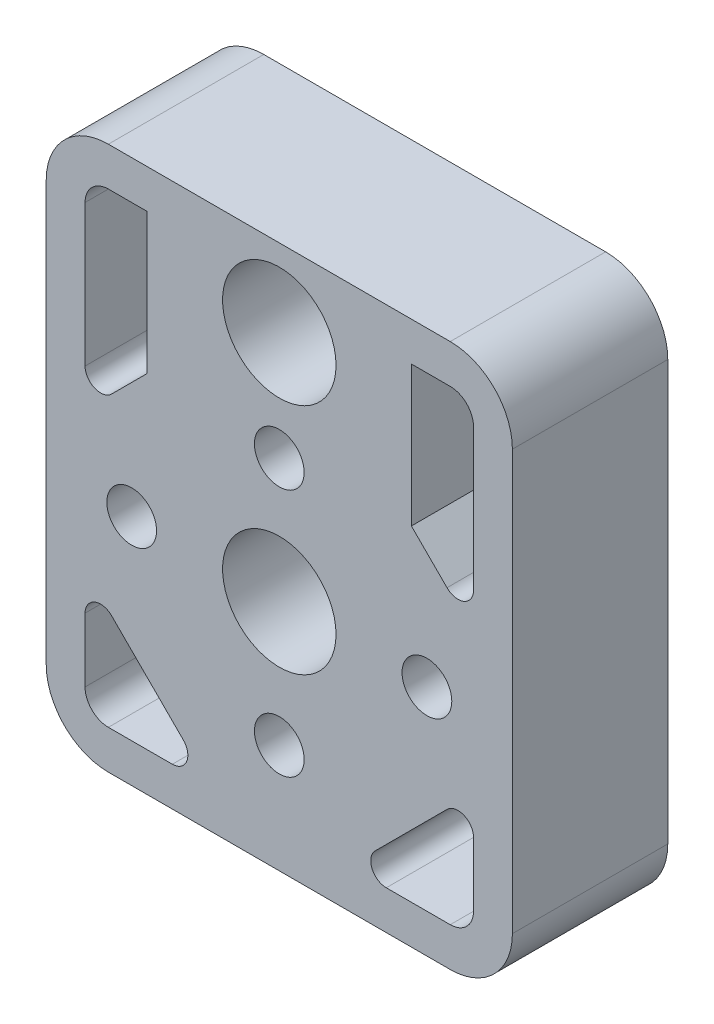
ISO-10303-21;
HEADER;
FILE_DESCRIPTION(('STEP AP214'),'2;1');
FILE_NAME('part.step','',(''),(''),'','','');
FILE_SCHEMA(('AUTOMOTIVE_DESIGN { 1 0 10303 214 1 1 1 1 }'));
ENDSEC;
DATA;
#1=APPLICATION_CONTEXT('core data for automotive mechanical design processes');
#2=APPLICATION_PROTOCOL_DEFINITION('international standard','automotive_design',2000,#1);
#3=PRODUCT_CONTEXT('',#1,'mechanical');
#4=PRODUCT('Part','Part','',(#3));
#5=PRODUCT_RELATED_PRODUCT_CATEGORY('part','',(#4));
#6=PRODUCT_DEFINITION_FORMATION('','',#4);
#7=PRODUCT_DEFINITION_CONTEXT('part definition',#1,'design');
#8=PRODUCT_DEFINITION('design','',#6,#7);
#9=PRODUCT_DEFINITION_SHAPE('','',#8);
#10=(LENGTH_UNIT() NAMED_UNIT(*) SI_UNIT(.MILLI.,.METRE.));
#11=(NAMED_UNIT(*) PLANE_ANGLE_UNIT() SI_UNIT($,.RADIAN.));
#12=(NAMED_UNIT(*) SI_UNIT($,.STERADIAN.) SOLID_ANGLE_UNIT());
#13=UNCERTAINTY_MEASURE_WITH_UNIT(LENGTH_MEASURE(1.E-05),#10,'distance_accuracy_value','');
#14=(GEOMETRIC_REPRESENTATION_CONTEXT(3) GLOBAL_UNCERTAINTY_ASSIGNED_CONTEXT((#13)) GLOBAL_UNIT_ASSIGNED_CONTEXT((#10,
#11,#12)) REPRESENTATION_CONTEXT('',''));
#15=CARTESIAN_POINT('',(0.,0.,0.));
#16=DIRECTION('',(0.,0.,1.));
#17=DIRECTION('',(1.,0.,0.));
#18=AXIS2_PLACEMENT_3D('',#15,#16,#17);
#19=CARTESIAN_POINT('',(15.,30.,10.));
#20=DIRECTION('',(0.,0.,-1.));
#21=DIRECTION('',(-1.,0.,0.));
#22=AXIS2_PLACEMENT_3D('',#19,#20,#21);
#23=CYLINDRICAL_SURFACE('',#22,2.05);
#24=CARTESIAN_POINT('',(15.,30.,0.));
#25=DIRECTION('',(0.,0.,1.));
#26=DIRECTION('',(1.,0.,0.));
#27=AXIS2_PLACEMENT_3D('',#24,#25,#26);
#28=CIRCLE('',#27,2.05);
#29=CARTESIAN_POINT('',(17.05,30.,0.));
#30=VERTEX_POINT('',#29);
#31=EDGE_CURVE('E499',#30,#30,#28,.T.);
#32=ORIENTED_EDGE('',*,*,#31,.F.);
#33=EDGE_LOOP('',(#32));
#34=FACE_BOUND('',#33,.T.);
#35=CARTESIAN_POINT('',(15.,30.,3.));
#36=DIRECTION('',(0.,0.,1.));
#37=DIRECTION('',(1.,0.,0.));
#38=AXIS2_PLACEMENT_3D('',#35,#36,#37);
#39=CIRCLE('',#38,2.05);
#40=CARTESIAN_POINT('',(17.05,30.,3.));
#41=VERTEX_POINT('',#40);
#42=EDGE_CURVE('E482',#41,#41,#39,.T.);
#43=ORIENTED_EDGE('',*,*,#42,.T.);
#44=EDGE_LOOP('',(#43));
#45=FACE_BOUND('',#44,.T.);
#46=ADVANCED_FACE('F37',(#34,#45),#23,.F.);
#47=CARTESIAN_POINT('',(15.,15.,10.));
#48=DIRECTION('',(0.,0.,-1.));
#49=DIRECTION('',(-1.,0.,0.));
#50=AXIS2_PLACEMENT_3D('',#47,#48,#49);
#51=CYLINDRICAL_SURFACE('',#50,2.1);
#52=CARTESIAN_POINT('',(15.,15.,0.));
#53=DIRECTION('',(0.,0.,1.));
#54=DIRECTION('',(1.,0.,0.));
#55=AXIS2_PLACEMENT_3D('',#52,#53,#54);
#56=CIRCLE('',#55,2.1);
#57=CARTESIAN_POINT('',(17.1,15.,0.));
#58=VERTEX_POINT('',#57);
#59=EDGE_CURVE('E496',#58,#58,#56,.T.);
#60=ORIENTED_EDGE('',*,*,#59,.F.);
#61=EDGE_LOOP('',(#60));
#62=FACE_BOUND('',#61,.T.);
#63=CARTESIAN_POINT('',(15.,15.,3.));
#64=DIRECTION('',(0.,0.,1.));
#65=DIRECTION('',(1.,0.,0.));
#66=AXIS2_PLACEMENT_3D('',#63,#64,#65);
#67=CIRCLE('',#66,2.1);
#68=CARTESIAN_POINT('',(17.1,15.,3.));
#69=VERTEX_POINT('',#68);
#70=EDGE_CURVE('E448',#69,#69,#67,.T.);
#71=ORIENTED_EDGE('',*,*,#70,.T.);
#72=EDGE_LOOP('',(#71));
#73=FACE_BOUND('',#72,.T.);
#74=ADVANCED_FACE('F622',(#62,#73),#51,.F.);
#75=CARTESIAN_POINT('',(24.5,15.,10.));
#76=DIRECTION('',(0.,0.,-1.));
#77=DIRECTION('',(-1.,0.,0.));
#78=AXIS2_PLACEMENT_3D('',#75,#76,#77);
#79=CYLINDRICAL_SURFACE('',#78,1.6);
#80=CARTESIAN_POINT('',(24.5,15.,10.));
#81=DIRECTION('',(0.,0.,1.));
#82=DIRECTION('',(1.,0.,0.));
#83=AXIS2_PLACEMENT_3D('',#80,#81,#82);
#84=CIRCLE('',#83,1.6);
#85=CARTESIAN_POINT('',(26.1,15.,10.));
#86=VERTEX_POINT('',#85);
#87=EDGE_CURVE('E493',#86,#86,#84,.T.);
#88=ORIENTED_EDGE('',*,*,#87,.T.);
#89=EDGE_LOOP('',(#88));
#90=FACE_BOUND('',#89,.T.);
#91=CARTESIAN_POINT('',(24.5,15.,5.));
#92=DIRECTION('',(0.,0.,-1.));
#93=DIRECTION('',(-1.,0.,0.));
#94=AXIS2_PLACEMENT_3D('',#91,#92,#93);
#95=CIRCLE('',#94,1.6);
#96=CARTESIAN_POINT('',(22.9,15.,5.));
#97=VERTEX_POINT('',#96);
#98=EDGE_CURVE('E487',#97,#97,#95,.T.);
#99=ORIENTED_EDGE('',*,*,#98,.T.);
#100=EDGE_LOOP('',(#99));
#101=FACE_BOUND('',#100,.T.);
#102=ADVANCED_FACE('F629',(#90,#101),#79,.F.);
#103=CARTESIAN_POINT('',(15.,7.,10.));
#104=DIRECTION('',(0.,0.,-1.));
#105=DIRECTION('',(-1.,0.,0.));
#106=AXIS2_PLACEMENT_3D('',#103,#104,#105);
#107=CYLINDRICAL_SURFACE('',#106,1.6);
#108=CARTESIAN_POINT('',(15.,7.,10.));
#109=DIRECTION('',(0.,0.,1.));
#110=DIRECTION('',(1.,0.,0.));
#111=AXIS2_PLACEMENT_3D('',#108,#109,#110);
#112=CIRCLE('',#111,1.6);
#113=CARTESIAN_POINT('',(16.6,7.,10.));
#114=VERTEX_POINT('',#113);
#115=EDGE_CURVE('E490',#114,#114,#112,.T.);
#116=ORIENTED_EDGE('',*,*,#115,.T.);
#117=EDGE_LOOP('',(#116));
#118=FACE_BOUND('',#117,.T.);
#119=CARTESIAN_POINT('',(15.,7.,5.));
#120=DIRECTION('',(0.,0.,-1.));
#121=DIRECTION('',(-1.,0.,0.));
#122=AXIS2_PLACEMENT_3D('',#119,#120,#121);
#123=CIRCLE('',#122,1.6);
#124=CARTESIAN_POINT('',(13.4,7.,5.));
#125=VERTEX_POINT('',#124);
#126=EDGE_CURVE('E532',#125,#125,#123,.T.);
#127=ORIENTED_EDGE('',*,*,#126,.T.);
#128=EDGE_LOOP('',(#127));
#129=FACE_BOUND('',#128,.T.);
#130=ADVANCED_FACE('F900',(#118,#129),#107,.F.);
#131=CARTESIAN_POINT('',(5.5,15.,10.));
#132=DIRECTION('',(0.,0.,-1.));
#133=DIRECTION('',(-1.,0.,0.));
#134=AXIS2_PLACEMENT_3D('',#131,#132,#133);
#135=CYLINDRICAL_SURFACE('',#134,1.6);
#136=CARTESIAN_POINT('',(5.5,15.,10.));
#137=DIRECTION('',(0.,0.,1.));
#138=DIRECTION('',(1.,0.,0.));
#139=AXIS2_PLACEMENT_3D('',#136,#137,#138);
#140=CIRCLE('',#139,1.6);
#141=CARTESIAN_POINT('',(7.1,15.,10.));
#142=VERTEX_POINT('',#141);
#143=EDGE_CURVE('E486',#142,#142,#140,.T.);
#144=ORIENTED_EDGE('',*,*,#143,.T.);
#145=EDGE_LOOP('',(#144));
#146=FACE_BOUND('',#145,.T.);
#147=CARTESIAN_POINT('',(5.5,15.,5.));
#148=DIRECTION('',(0.,0.,-1.));
#149=DIRECTION('',(-1.,0.,0.));
#150=AXIS2_PLACEMENT_3D('',#147,#148,#149);
#151=CIRCLE('',#150,1.6);
#152=CARTESIAN_POINT('',(3.9,15.,5.));
#153=VERTEX_POINT('',#152);
#154=EDGE_CURVE('E529',#153,#153,#151,.T.);
#155=ORIENTED_EDGE('',*,*,#154,.T.);
#156=EDGE_LOOP('',(#155));
#157=FACE_BOUND('',#156,.T.);
#158=ADVANCED_FACE('F896',(#146,#157),#135,.F.);
#159=CARTESIAN_POINT('',(15.,23.,10.));
#160=DIRECTION('',(0.,0.,-1.));
#161=DIRECTION('',(-1.,0.,0.));
#162=AXIS2_PLACEMENT_3D('',#159,#160,#161);
#163=CYLINDRICAL_SURFACE('',#162,1.6);
#164=CARTESIAN_POINT('',(15.,23.,10.));
#165=DIRECTION('',(0.,0.,1.));
#166=DIRECTION('',(1.,0.,0.));
#167=AXIS2_PLACEMENT_3D('',#164,#165,#166);
#168=CIRCLE('',#167,1.6);
#169=CARTESIAN_POINT('',(16.6,23.,10.));
#170=VERTEX_POINT('',#169);
#171=EDGE_CURVE('E483',#170,#170,#168,.T.);
#172=ORIENTED_EDGE('',*,*,#171,.T.);
#173=EDGE_LOOP('',(#172));
#174=FACE_BOUND('',#173,.T.);
#175=CARTESIAN_POINT('',(15.,23.,5.));
#176=DIRECTION('',(0.,0.,-1.));
#177=DIRECTION('',(-1.,0.,0.));
#178=AXIS2_PLACEMENT_3D('',#175,#176,#177);
#179=CIRCLE('',#178,1.6);
#180=CARTESIAN_POINT('',(13.4,23.,5.));
#181=VERTEX_POINT('',#180);
#182=EDGE_CURVE('E460',#181,#181,#179,.T.);
#183=ORIENTED_EDGE('',*,*,#182,.T.);
#184=EDGE_LOOP('',(#183));
#185=FACE_BOUND('',#184,.T.);
#186=ADVANCED_FACE('F637',(#174,#185),#163,.F.);
#187=CARTESIAN_POINT('',(0.,0.,10.));
#188=DIRECTION('',(0.,0.,-1.));
#189=DIRECTION('',(-1.,0.,0.));
#190=AXIS2_PLACEMENT_3D('',#187,#188,#189);
#191=PLANE('',#190);
#192=DIRECTION('',(0.,1.,0.));
#193=VECTOR('',#192,1.);
#194=CARTESIAN_POINT('',(27.5,31.,10.));
#195=LINE('',#194,#193);
#196=CARTESIAN_POINT('',(27.5,21.8847763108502,10.));
#197=VERTEX_POINT('',#196);
#198=CARTESIAN_POINT('',(27.5,31.,10.));
#199=VERTEX_POINT('',#198);
#200=EDGE_CURVE('E373',#197,#199,#195,.T.);
#201=ORIENTED_EDGE('',*,*,#200,.F.);
#202=CARTESIAN_POINT('',(26.5,21.8847763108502,10.));
#203=DIRECTION('',(0.,0.,1.));
#204=DIRECTION('',(1.,0.,0.));
#205=AXIS2_PLACEMENT_3D('',#202,#203,#204);
#206=CIRCLE('',#205,1.);
#207=CARTESIAN_POINT('',(25.7928932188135,21.1776695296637,10.));
#208=VERTEX_POINT('',#207);
#209=EDGE_CURVE('E52',#208,#197,#206,.T.);
#210=ORIENTED_EDGE('',*,*,#209,.F.);
#211=DIRECTION('',(0.707106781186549,-0.707106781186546,0.));
#212=VECTOR('',#211,1.);
#213=CARTESIAN_POINT('',(23.5,23.4705627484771,10.));
#214=LINE('',#213,#212);
#215=CARTESIAN_POINT('',(23.5,23.4705627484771,10.));
#216=VERTEX_POINT('',#215);
#217=EDGE_CURVE('E356',#216,#208,#214,.T.);
#218=ORIENTED_EDGE('',*,*,#217,.F.);
#219=DIRECTION('',(0.,-1.,0.));
#220=VECTOR('',#219,1.);
#221=CARTESIAN_POINT('',(23.5,32.5,10.));
#222=LINE('',#221,#220);
#223=CARTESIAN_POINT('',(23.5,32.5,10.));
#224=VERTEX_POINT('',#223);
#225=EDGE_CURVE('E382',#224,#216,#222,.T.);
#226=ORIENTED_EDGE('',*,*,#225,.F.);
#227=DIRECTION('',(-1.,0.,0.));
#228=VECTOR('',#227,1.);
#229=CARTESIAN_POINT('',(23.5,32.5,10.));
#230=LINE('',#229,#228);
#231=CARTESIAN_POINT('',(26.,32.5,10.));
#232=VERTEX_POINT('',#231);
#233=EDGE_CURVE('E379',#232,#224,#230,.T.);
#234=ORIENTED_EDGE('',*,*,#233,.F.);
#235=CARTESIAN_POINT('',(26.,31.,10.));
#236=DIRECTION('',(0.,0.,1.));
#237=DIRECTION('',(-1.,0.,0.));
#238=AXIS2_PLACEMENT_3D('',#235,#236,#237);
#239=CIRCLE('',#238,1.5);
#240=EDGE_CURVE('E376',#199,#232,#239,.T.);
#241=ORIENTED_EDGE('',*,*,#240,.F.);
#242=EDGE_LOOP('',(#201,#210,#218,#226,#234,#241));
#243=FACE_BOUND('',#242,.T.);
#244=DIRECTION('',(1.,0.,0.));
#245=VECTOR('',#244,1.);
#246=CARTESIAN_POINT('',(26.,2.5,10.));
#247=LINE('',#246,#245);
#248=CARTESIAN_POINT('',(21.8847763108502,2.5,10.));
#249=VERTEX_POINT('',#248);
#250=CARTESIAN_POINT('',(26.,2.5,10.));
#251=VERTEX_POINT('',#250);
#252=EDGE_CURVE('E327',#249,#251,#247,.T.);
#253=ORIENTED_EDGE('',*,*,#252,.F.);
#254=CARTESIAN_POINT('',(21.8847763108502,3.5,10.));
#255=DIRECTION('',(0.,0.,1.));
#256=DIRECTION('',(1.,0.,0.));
#257=AXIS2_PLACEMENT_3D('',#254,#255,#256);
#258=CIRCLE('',#257,1.);
#259=CARTESIAN_POINT('',(21.1776695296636,4.20710678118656,10.));
#260=VERTEX_POINT('',#259);
#261=EDGE_CURVE('E60',#260,#249,#258,.T.);
#262=ORIENTED_EDGE('',*,*,#261,.F.);
#263=DIRECTION('',(-0.707106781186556,-0.707106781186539,0.));
#264=VECTOR('',#263,1.);
#265=CARTESIAN_POINT('',(25.7928932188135,8.82233047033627,10.));
#266=LINE('',#265,#264);
#267=CARTESIAN_POINT('',(25.7928932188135,8.82233047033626,10.));
#268=VERTEX_POINT('',#267);
#269=EDGE_CURVE('E310',#268,#260,#266,.T.);
#270=ORIENTED_EDGE('',*,*,#269,.F.);
#271=CARTESIAN_POINT('',(26.5,8.11522368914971,10.));
#272=DIRECTION('',(0.,0.,1.));
#273=DIRECTION('',(-1.,0.,0.));
#274=AXIS2_PLACEMENT_3D('',#271,#272,#273);
#275=CIRCLE('',#274,1.);
#276=CARTESIAN_POINT('',(27.5,8.11522368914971,10.));
#277=VERTEX_POINT('',#276);
#278=EDGE_CURVE('E337',#277,#268,#275,.T.);
#279=ORIENTED_EDGE('',*,*,#278,.F.);
#280=DIRECTION('',(0.,1.,0.));
#281=VECTOR('',#280,1.);
#282=CARTESIAN_POINT('',(27.5,8.11522368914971,10.));
#283=LINE('',#282,#281);
#284=CARTESIAN_POINT('',(27.5,4.,10.));
#285=VERTEX_POINT('',#284);
#286=EDGE_CURVE('E334',#285,#277,#283,.T.);
#287=ORIENTED_EDGE('',*,*,#286,.F.);
#288=CARTESIAN_POINT('',(26.,4.,10.));
#289=DIRECTION('',(0.,0.,1.));
#290=DIRECTION('',(-1.,0.,0.));
#291=AXIS2_PLACEMENT_3D('',#288,#289,#290);
#292=CIRCLE('',#291,1.5);
#293=EDGE_CURVE('E331',#251,#285,#292,.T.);
#294=ORIENTED_EDGE('',*,*,#293,.F.);
#295=EDGE_LOOP('',(#253,#262,#270,#279,#287,#294));
#296=FACE_BOUND('',#295,.T.);
#297=DIRECTION('',(0.,-1.,0.));
#298=VECTOR('',#297,1.);
#299=CARTESIAN_POINT('',(2.5,8.11522368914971,10.));
#300=LINE('',#299,#298);
#301=CARTESIAN_POINT('',(2.5,8.11522368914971,10.));
#302=VERTEX_POINT('',#301);
#303=CARTESIAN_POINT('',(2.5,4.,10.));
#304=VERTEX_POINT('',#303);
#305=EDGE_CURVE('E285',#302,#304,#300,.T.);
#306=ORIENTED_EDGE('',*,*,#305,.F.);
#307=CARTESIAN_POINT('',(3.5,8.1152236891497,10.));
#308=DIRECTION('',(0.,0.,1.));
#309=DIRECTION('',(1.,0.,0.));
#310=AXIS2_PLACEMENT_3D('',#307,#308,#309);
#311=CIRCLE('',#310,1.);
#312=CARTESIAN_POINT('',(4.20710678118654,8.82233047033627,10.));
#313=VERTEX_POINT('',#312);
#314=EDGE_CURVE('E252',#313,#302,#311,.T.);
#315=ORIENTED_EDGE('',*,*,#314,.F.);
#316=DIRECTION('',(-0.707106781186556,0.707106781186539,0.));
#317=VECTOR('',#316,1.);
#318=CARTESIAN_POINT('',(4.20710678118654,8.82233047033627,10.));
#319=LINE('',#318,#317);
#320=CARTESIAN_POINT('',(8.82233047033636,4.20710678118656,10.));
#321=VERTEX_POINT('',#320);
#322=EDGE_CURVE('E271',#321,#313,#319,.T.);
#323=ORIENTED_EDGE('',*,*,#322,.F.);
#324=CARTESIAN_POINT('',(8.11522368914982,3.5,10.));
#325=DIRECTION('',(0.,0.,1.));
#326=DIRECTION('',(-1.,0.,0.));
#327=AXIS2_PLACEMENT_3D('',#324,#325,#326);
#328=CIRCLE('',#327,1.);
#329=CARTESIAN_POINT('',(8.11522368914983,2.5,10.));
#330=VERTEX_POINT('',#329);
#331=EDGE_CURVE('E274',#330,#321,#328,.T.);
#332=ORIENTED_EDGE('',*,*,#331,.F.);
#333=DIRECTION('',(1.,0.,0.));
#334=VECTOR('',#333,1.);
#335=CARTESIAN_POINT('',(4.,2.5,10.));
#336=LINE('',#335,#334);
#337=CARTESIAN_POINT('',(4.,2.5,10.));
#338=VERTEX_POINT('',#337);
#339=EDGE_CURVE('E291',#338,#330,#336,.T.);
#340=ORIENTED_EDGE('',*,*,#339,.F.);
#341=CARTESIAN_POINT('',(4.,4.,10.));
#342=DIRECTION('',(0.,0.,1.));
#343=DIRECTION('',(1.,0.,0.));
#344=AXIS2_PLACEMENT_3D('',#341,#342,#343);
#345=CIRCLE('',#344,1.5);
#346=EDGE_CURVE('E288',#304,#338,#345,.T.);
#347=ORIENTED_EDGE('',*,*,#346,.F.);
#348=EDGE_LOOP('',(#306,#315,#323,#332,#340,#347));
#349=FACE_BOUND('',#348,.T.);
#350=CARTESIAN_POINT('',(4.,31.,10.));
#351=DIRECTION('',(0.,0.,1.));
#352=DIRECTION('',(1.,0.,0.));
#353=AXIS2_PLACEMENT_3D('',#350,#351,#352);
#354=CIRCLE('',#353,1.5);
#355=CARTESIAN_POINT('',(4.,32.5,10.));
#356=VERTEX_POINT('',#355);
#357=CARTESIAN_POINT('',(2.5,31.,10.));
#358=VERTEX_POINT('',#357);
#359=EDGE_CURVE('E418',#356,#358,#354,.T.);
#360=ORIENTED_EDGE('',*,*,#359,.F.);
#361=DIRECTION('',(-1.,0.,0.));
#362=VECTOR('',#361,1.);
#363=CARTESIAN_POINT('',(6.5,32.5,10.));
#364=LINE('',#363,#362);
#365=CARTESIAN_POINT('',(6.5,32.5,10.));
#366=VERTEX_POINT('',#365);
#367=EDGE_CURVE('E298',#366,#356,#364,.T.);
#368=ORIENTED_EDGE('',*,*,#367,.F.);
#369=DIRECTION('',(0.,1.,0.));
#370=VECTOR('',#369,1.);
#371=CARTESIAN_POINT('',(6.5,32.5,10.));
#372=LINE('',#371,#370);
#373=CARTESIAN_POINT('',(6.5,23.4705627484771,10.));
#374=VERTEX_POINT('',#373);
#375=EDGE_CURVE('E401',#374,#366,#372,.T.);
#376=ORIENTED_EDGE('',*,*,#375,.F.);
#377=DIRECTION('',(0.707106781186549,0.707106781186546,0.));
#378=VECTOR('',#377,1.);
#379=CARTESIAN_POINT('',(6.5,23.4705627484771,10.));
#380=LINE('',#379,#378);
#381=CARTESIAN_POINT('',(4.20710678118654,21.1776695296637,10.));
#382=VERTEX_POINT('',#381);
#383=EDGE_CURVE('E427',#382,#374,#380,.T.);
#384=ORIENTED_EDGE('',*,*,#383,.F.);
#385=CARTESIAN_POINT('',(3.5,21.8847763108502,10.));
#386=DIRECTION('',(0.,0.,1.));
#387=DIRECTION('',(-1.,0.,0.));
#388=AXIS2_PLACEMENT_3D('',#385,#386,#387);
#389=CIRCLE('',#388,1.);
#390=CARTESIAN_POINT('',(2.5,21.8847763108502,10.));
#391=VERTEX_POINT('',#390);
#392=EDGE_CURVE('E424',#391,#382,#389,.T.);
#393=ORIENTED_EDGE('',*,*,#392,.F.);
#394=DIRECTION('',(0.,-1.,0.));
#395=VECTOR('',#394,1.);
#396=CARTESIAN_POINT('',(2.5,31.,10.));
#397=LINE('',#396,#395);
#398=EDGE_CURVE('E421',#358,#391,#397,.T.);
#399=ORIENTED_EDGE('',*,*,#398,.F.);
#400=EDGE_LOOP('',(#360,#368,#376,#384,#393,#399));
#401=FACE_BOUND('',#400,.T.);
#402=CARTESIAN_POINT('',(15.,15.,10.));
#403=DIRECTION('',(0.,0.,1.));
#404=DIRECTION('',(1.,0.,0.));
#405=AXIS2_PLACEMENT_3D('',#402,#403,#404);
#406=CIRCLE('',#405,3.65);
#407=CARTESIAN_POINT('',(18.65,15.,10.));
#408=VERTEX_POINT('',#407);
#409=EDGE_CURVE('E449',#408,#408,#406,.T.);
#410=ORIENTED_EDGE('',*,*,#409,.F.);
#411=EDGE_LOOP('',(#410));
#412=FACE_BOUND('',#411,.T.);
#413=CARTESIAN_POINT('',(15.,30.,10.));
#414=DIRECTION('',(0.,0.,1.));
#415=DIRECTION('',(1.,0.,0.));
#416=AXIS2_PLACEMENT_3D('',#413,#414,#415);
#417=CIRCLE('',#416,3.65);
#418=CARTESIAN_POINT('',(18.65,30.,10.));
#419=VERTEX_POINT('',#418);
#420=EDGE_CURVE('E434',#419,#419,#417,.T.);
#421=ORIENTED_EDGE('',*,*,#420,.F.);
#422=EDGE_LOOP('',(#421));
#423=FACE_BOUND('',#422,.T.);
#424=DIRECTION('',(-1.,0.,0.));
#425=VECTOR('',#424,1.);
#426=CARTESIAN_POINT('',(0.,35.,10.));
#427=LINE('',#426,#425);
#428=CARTESIAN_POINT('',(26.,35.,10.));
#429=VERTEX_POINT('',#428);
#430=CARTESIAN_POINT('',(4.,35.,10.));
#431=VERTEX_POINT('',#430);
#432=EDGE_CURVE('E513',#429,#431,#427,.T.);
#433=ORIENTED_EDGE('',*,*,#432,.T.);
#434=CARTESIAN_POINT('',(4.,31.,10.));
#435=DIRECTION('',(0.,0.,-1.));
#436=DIRECTION('',(-1.,0.,0.));
#437=AXIS2_PLACEMENT_3D('',#434,#435,#436);
#438=CIRCLE('',#437,4.);
#439=CARTESIAN_POINT('',(0.,31.,10.));
#440=VERTEX_POINT('',#439);
#441=EDGE_CURVE('E564',#431,#440,#438,.F.);
#442=ORIENTED_EDGE('',*,*,#441,.T.);
#443=DIRECTION('',(0.,-1.,0.));
#444=VECTOR('',#443,1.);
#445=CARTESIAN_POINT('',(0.,0.,10.));
#446=LINE('',#445,#444);
#447=CARTESIAN_POINT('',(0.,4.,10.));
#448=VERTEX_POINT('',#447);
#449=EDGE_CURVE('E503',#440,#448,#446,.T.);
#450=ORIENTED_EDGE('',*,*,#449,.T.);
#451=CARTESIAN_POINT('',(4.,4.,10.));
#452=DIRECTION('',(0.,0.,-1.));
#453=DIRECTION('',(-1.,0.,0.));
#454=AXIS2_PLACEMENT_3D('',#451,#452,#453);
#455=CIRCLE('',#454,4.);
#456=CARTESIAN_POINT('',(4.,0.,10.));
#457=VERTEX_POINT('',#456);
#458=EDGE_CURVE('E558',#448,#457,#455,.F.);
#459=ORIENTED_EDGE('',*,*,#458,.T.);
#460=DIRECTION('',(1.,0.,0.));
#461=VECTOR('',#460,1.);
#462=CARTESIAN_POINT('',(0.,0.,10.));
#463=LINE('',#462,#461);
#464=CARTESIAN_POINT('',(26.,0.,10.));
#465=VERTEX_POINT('',#464);
#466=EDGE_CURVE('E506',#457,#465,#463,.T.);
#467=ORIENTED_EDGE('',*,*,#466,.T.);
#468=CARTESIAN_POINT('',(26.,4.,10.));
#469=DIRECTION('',(0.,0.,-1.));
#470=DIRECTION('',(-1.,0.,0.));
#471=AXIS2_PLACEMENT_3D('',#468,#469,#470);
#472=CIRCLE('',#471,4.);
#473=CARTESIAN_POINT('',(30.,4.,10.));
#474=VERTEX_POINT('',#473);
#475=EDGE_CURVE('E560',#465,#474,#472,.F.);
#476=ORIENTED_EDGE('',*,*,#475,.T.);
#477=DIRECTION('',(0.,1.,0.));
#478=VECTOR('',#477,1.);
#479=CARTESIAN_POINT('',(30.,0.,10.));
#480=LINE('',#479,#478);
#481=CARTESIAN_POINT('',(30.,31.,10.));
#482=VERTEX_POINT('',#481);
#483=EDGE_CURVE('E510',#474,#482,#480,.T.);
#484=ORIENTED_EDGE('',*,*,#483,.T.);
#485=CARTESIAN_POINT('',(26.,31.,10.));
#486=DIRECTION('',(0.,0.,-1.));
#487=DIRECTION('',(-1.,0.,0.));
#488=AXIS2_PLACEMENT_3D('',#485,#486,#487);
#489=CIRCLE('',#488,4.);
#490=EDGE_CURVE('E562',#482,#429,#489,.F.);
#491=ORIENTED_EDGE('',*,*,#490,.T.);
#492=EDGE_LOOP('',(#433,#442,#450,#459,#467,#476,#484,#491));
#493=FACE_BOUND('',#492,.T.);
#494=ORIENTED_EDGE('',*,*,#87,.F.);
#495=EDGE_LOOP('',(#494));
#496=FACE_BOUND('',#495,.T.);
#497=ORIENTED_EDGE('',*,*,#115,.F.);
#498=EDGE_LOOP('',(#497));
#499=FACE_BOUND('',#498,.T.);
#500=ORIENTED_EDGE('',*,*,#143,.F.);
#501=EDGE_LOOP('',(#500));
#502=FACE_BOUND('',#501,.T.);
#503=ORIENTED_EDGE('',*,*,#171,.F.);
#504=EDGE_LOOP('',(#503));
#505=FACE_BOUND('',#504,.T.);
#506=ADVANCED_FACE('F593',(#243,#296,#349,#401,#412,#423,#493,#496,#499,#502,#505),#191,.F.);
#507=CARTESIAN_POINT('',(0.,0.,0.));
#508=DIRECTION('',(0.,0.,-1.));
#509=DIRECTION('',(-1.,0.,0.));
#510=AXIS2_PLACEMENT_3D('',#507,#508,#509);
#511=PLANE('',#510);
#512=CARTESIAN_POINT('',(26.5,21.8847763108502,0.));
#513=DIRECTION('',(0.,0.,1.));
#514=DIRECTION('',(1.,0.,0.));
#515=AXIS2_PLACEMENT_3D('',#512,#513,#514);
#516=CIRCLE('',#515,1.);
#517=CARTESIAN_POINT('',(25.7928932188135,21.1776695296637,0.));
#518=VERTEX_POINT('',#517);
#519=CARTESIAN_POINT('',(27.5,21.8847763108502,0.));
#520=VERTEX_POINT('',#519);
#521=EDGE_CURVE('E352',#518,#520,#516,.T.);
#522=ORIENTED_EDGE('',*,*,#521,.T.);
#523=DIRECTION('',(0.,1.,0.));
#524=VECTOR('',#523,1.);
#525=CARTESIAN_POINT('',(27.5,31.,0.));
#526=LINE('',#525,#524);
#527=CARTESIAN_POINT('',(27.5,31.,0.));
#528=VERTEX_POINT('',#527);
#529=EDGE_CURVE('E355',#520,#528,#526,.T.);
#530=ORIENTED_EDGE('',*,*,#529,.T.);
#531=CARTESIAN_POINT('',(26.,31.,0.));
#532=DIRECTION('',(0.,0.,1.));
#533=DIRECTION('',(-1.,0.,0.));
#534=AXIS2_PLACEMENT_3D('',#531,#532,#533);
#535=CIRCLE('',#534,1.5);
#536=CARTESIAN_POINT('',(26.,32.5,0.));
#537=VERTEX_POINT('',#536);
#538=EDGE_CURVE('E359',#528,#537,#535,.T.);
#539=ORIENTED_EDGE('',*,*,#538,.T.);
#540=DIRECTION('',(-1.,0.,0.));
#541=VECTOR('',#540,1.);
#542=CARTESIAN_POINT('',(23.5,32.5,0.));
#543=LINE('',#542,#541);
#544=CARTESIAN_POINT('',(23.5,32.5,0.));
#545=VERTEX_POINT('',#544);
#546=EDGE_CURVE('E362',#537,#545,#543,.T.);
#547=ORIENTED_EDGE('',*,*,#546,.T.);
#548=DIRECTION('',(0.,-1.,0.));
#549=VECTOR('',#548,1.);
#550=CARTESIAN_POINT('',(23.5,32.5,0.));
#551=LINE('',#550,#549);
#552=CARTESIAN_POINT('',(23.5,23.4705627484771,0.));
#553=VERTEX_POINT('',#552);
#554=EDGE_CURVE('E365',#545,#553,#551,.T.);
#555=ORIENTED_EDGE('',*,*,#554,.T.);
#556=DIRECTION('',(0.707106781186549,-0.707106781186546,0.));
#557=VECTOR('',#556,1.);
#558=CARTESIAN_POINT('',(23.5,23.4705627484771,0.));
#559=LINE('',#558,#557);
#560=EDGE_CURVE('E368',#553,#518,#559,.T.);
#561=ORIENTED_EDGE('',*,*,#560,.T.);
#562=EDGE_LOOP('',(#522,#530,#539,#547,#555,#561));
#563=FACE_BOUND('',#562,.T.);
#564=CARTESIAN_POINT('',(21.8847763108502,3.5,0.));
#565=DIRECTION('',(0.,0.,1.));
#566=DIRECTION('',(1.,0.,0.));
#567=AXIS2_PLACEMENT_3D('',#564,#565,#566);
#568=CIRCLE('',#567,1.);
#569=CARTESIAN_POINT('',(21.1776695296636,4.20710678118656,0.));
#570=VERTEX_POINT('',#569);
#571=CARTESIAN_POINT('',(21.8847763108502,2.5,0.));
#572=VERTEX_POINT('',#571);
#573=EDGE_CURVE('E306',#570,#572,#568,.T.);
#574=ORIENTED_EDGE('',*,*,#573,.T.);
#575=DIRECTION('',(1.,0.,0.));
#576=VECTOR('',#575,1.);
#577=CARTESIAN_POINT('',(26.,2.5,0.));
#578=LINE('',#577,#576);
#579=CARTESIAN_POINT('',(26.,2.5,0.));
#580=VERTEX_POINT('',#579);
#581=EDGE_CURVE('E309',#572,#580,#578,.T.);
#582=ORIENTED_EDGE('',*,*,#581,.T.);
#583=CARTESIAN_POINT('',(26.,4.,0.));
#584=DIRECTION('',(0.,0.,1.));
#585=DIRECTION('',(-1.,0.,0.));
#586=AXIS2_PLACEMENT_3D('',#583,#584,#585);
#587=CIRCLE('',#586,1.5);
#588=CARTESIAN_POINT('',(27.5,4.,0.));
#589=VERTEX_POINT('',#588);
#590=EDGE_CURVE('E313',#580,#589,#587,.T.);
#591=ORIENTED_EDGE('',*,*,#590,.T.);
#592=DIRECTION('',(0.,1.,0.));
#593=VECTOR('',#592,1.);
#594=CARTESIAN_POINT('',(27.5,8.11522368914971,0.));
#595=LINE('',#594,#593);
#596=CARTESIAN_POINT('',(27.5,8.11522368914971,0.));
#597=VERTEX_POINT('',#596);
#598=EDGE_CURVE('E316',#589,#597,#595,.T.);
#599=ORIENTED_EDGE('',*,*,#598,.T.);
#600=CARTESIAN_POINT('',(26.5,8.11522368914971,0.));
#601=DIRECTION('',(0.,0.,1.));
#602=DIRECTION('',(-1.,0.,0.));
#603=AXIS2_PLACEMENT_3D('',#600,#601,#602);
#604=CIRCLE('',#603,1.);
#605=CARTESIAN_POINT('',(25.7928932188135,8.82233047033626,0.));
#606=VERTEX_POINT('',#605);
#607=EDGE_CURVE('E319',#597,#606,#604,.T.);
#608=ORIENTED_EDGE('',*,*,#607,.T.);
#609=DIRECTION('',(-0.707106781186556,-0.707106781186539,0.));
#610=VECTOR('',#609,1.);
#611=CARTESIAN_POINT('',(25.7928932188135,8.82233047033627,0.));
#612=LINE('',#611,#610);
#613=EDGE_CURVE('E322',#606,#570,#612,.T.);
#614=ORIENTED_EDGE('',*,*,#613,.T.);
#615=EDGE_LOOP('',(#574,#582,#591,#599,#608,#614));
#616=FACE_BOUND('',#615,.T.);
#617=CARTESIAN_POINT('',(3.5,8.1152236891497,0.));
#618=DIRECTION('',(0.,0.,1.));
#619=DIRECTION('',(1.,0.,0.));
#620=AXIS2_PLACEMENT_3D('',#617,#618,#619);
#621=CIRCLE('',#620,1.);
#622=CARTESIAN_POINT('',(4.20710678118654,8.82233047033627,0.));
#623=VERTEX_POINT('',#622);
#624=CARTESIAN_POINT('',(2.5,8.11522368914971,0.));
#625=VERTEX_POINT('',#624);
#626=EDGE_CURVE('E249',#623,#625,#621,.T.);
#627=ORIENTED_EDGE('',*,*,#626,.T.);
#628=DIRECTION('',(0.,-1.,0.));
#629=VECTOR('',#628,1.);
#630=CARTESIAN_POINT('',(2.5,8.11522368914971,0.));
#631=LINE('',#630,#629);
#632=CARTESIAN_POINT('',(2.5,4.,0.));
#633=VERTEX_POINT('',#632);
#634=EDGE_CURVE('E261',#625,#633,#631,.T.);
#635=ORIENTED_EDGE('',*,*,#634,.T.);
#636=CARTESIAN_POINT('',(4.,4.,0.));
#637=DIRECTION('',(0.,0.,1.));
#638=DIRECTION('',(1.,0.,0.));
#639=AXIS2_PLACEMENT_3D('',#636,#637,#638);
#640=CIRCLE('',#639,1.5);
#641=CARTESIAN_POINT('',(4.,2.5,0.));
#642=VERTEX_POINT('',#641);
#643=EDGE_CURVE('E265',#633,#642,#640,.T.);
#644=ORIENTED_EDGE('',*,*,#643,.T.);
#645=DIRECTION('',(1.,0.,0.));
#646=VECTOR('',#645,1.);
#647=CARTESIAN_POINT('',(4.,2.5,0.));
#648=LINE('',#647,#646);
#649=CARTESIAN_POINT('',(8.11522368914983,2.5,0.));
#650=VERTEX_POINT('',#649);
#651=EDGE_CURVE('E278',#642,#650,#648,.T.);
#652=ORIENTED_EDGE('',*,*,#651,.T.);
#653=CARTESIAN_POINT('',(8.11522368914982,3.5,0.));
#654=DIRECTION('',(0.,0.,1.));
#655=DIRECTION('',(-1.,0.,0.));
#656=AXIS2_PLACEMENT_3D('',#653,#654,#655);
#657=CIRCLE('',#656,1.);
#658=CARTESIAN_POINT('',(8.82233047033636,4.20710678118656,0.));
#659=VERTEX_POINT('',#658);
#660=EDGE_CURVE('E281',#650,#659,#657,.T.);
#661=ORIENTED_EDGE('',*,*,#660,.T.);
#662=DIRECTION('',(-0.707106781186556,0.707106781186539,0.));
#663=VECTOR('',#662,1.);
#664=CARTESIAN_POINT('',(4.20710678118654,8.82233047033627,0.));
#665=LINE('',#664,#663);
#666=EDGE_CURVE('E257',#659,#623,#665,.T.);
#667=ORIENTED_EDGE('',*,*,#666,.T.);
#668=EDGE_LOOP('',(#627,#635,#644,#652,#661,#667));
#669=FACE_BOUND('',#668,.T.);
#670=DIRECTION('',(-1.,0.,0.));
#671=VECTOR('',#670,1.);
#672=CARTESIAN_POINT('',(6.5,32.5,0.));
#673=LINE('',#672,#671);
#674=CARTESIAN_POINT('',(6.5,32.5,0.));
#675=VERTEX_POINT('',#674);
#676=CARTESIAN_POINT('',(4.,32.5,0.));
#677=VERTEX_POINT('',#676);
#678=EDGE_CURVE('E397',#675,#677,#673,.T.);
#679=ORIENTED_EDGE('',*,*,#678,.T.);
#680=CARTESIAN_POINT('',(4.,31.,0.));
#681=DIRECTION('',(0.,0.,1.));
#682=DIRECTION('',(1.,0.,0.));
#683=AXIS2_PLACEMENT_3D('',#680,#681,#682);
#684=CIRCLE('',#683,1.5);
#685=CARTESIAN_POINT('',(2.5,31.,0.));
#686=VERTEX_POINT('',#685);
#687=EDGE_CURVE('E400',#677,#686,#684,.T.);
#688=ORIENTED_EDGE('',*,*,#687,.T.);
#689=DIRECTION('',(0.,-1.,0.));
#690=VECTOR('',#689,1.);
#691=CARTESIAN_POINT('',(2.5,31.,0.));
#692=LINE('',#691,#690);
#693=CARTESIAN_POINT('',(2.5,21.8847763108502,0.));
#694=VERTEX_POINT('',#693);
#695=EDGE_CURVE('E404',#686,#694,#692,.T.);
#696=ORIENTED_EDGE('',*,*,#695,.T.);
#697=CARTESIAN_POINT('',(3.5,21.8847763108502,0.));
#698=DIRECTION('',(0.,0.,1.));
#699=DIRECTION('',(-1.,0.,0.));
#700=AXIS2_PLACEMENT_3D('',#697,#698,#699);
#701=CIRCLE('',#700,1.);
#702=CARTESIAN_POINT('',(4.20710678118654,21.1776695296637,0.));
#703=VERTEX_POINT('',#702);
#704=EDGE_CURVE('E407',#694,#703,#701,.T.);
#705=ORIENTED_EDGE('',*,*,#704,.T.);
#706=DIRECTION('',(0.707106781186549,0.707106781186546,0.));
#707=VECTOR('',#706,1.);
#708=CARTESIAN_POINT('',(6.5,23.4705627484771,0.));
#709=LINE('',#708,#707);
#710=CARTESIAN_POINT('',(6.5,23.4705627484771,0.));
#711=VERTEX_POINT('',#710);
#712=EDGE_CURVE('E410',#703,#711,#709,.T.);
#713=ORIENTED_EDGE('',*,*,#712,.T.);
#714=DIRECTION('',(0.,1.,0.));
#715=VECTOR('',#714,1.);
#716=CARTESIAN_POINT('',(6.5,32.5,0.));
#717=LINE('',#716,#715);
#718=EDGE_CURVE('E413',#711,#675,#717,.T.);
#719=ORIENTED_EDGE('',*,*,#718,.T.);
#720=EDGE_LOOP('',(#679,#688,#696,#705,#713,#719));
#721=FACE_BOUND('',#720,.T.);
#722=CARTESIAN_POINT('',(15.,7.,0.));
#723=DIRECTION('',(0.,0.,-1.));
#724=DIRECTION('',(-1.,0.,0.));
#725=AXIS2_PLACEMENT_3D('',#722,#723,#724);
#726=CIRCLE('',#725,2.85);
#727=CARTESIAN_POINT('',(12.15,7.,0.));
#728=VERTEX_POINT('',#727);
#729=EDGE_CURVE('E461',#728,#728,#726,.T.);
#730=ORIENTED_EDGE('',*,*,#729,.F.);
#731=EDGE_LOOP('',(#730));
#732=FACE_BOUND('',#731,.T.);
#733=CARTESIAN_POINT('',(24.5,15.,0.));
#734=DIRECTION('',(0.,0.,-1.));
#735=DIRECTION('',(-1.,0.,0.));
#736=AXIS2_PLACEMENT_3D('',#733,#734,#735);
#737=CIRCLE('',#736,2.85);
#738=CARTESIAN_POINT('',(21.65,15.,0.));
#739=VERTEX_POINT('',#738);
#740=EDGE_CURVE('E467',#739,#739,#737,.T.);
#741=ORIENTED_EDGE('',*,*,#740,.F.);
#742=EDGE_LOOP('',(#741));
#743=FACE_BOUND('',#742,.T.);
#744=CARTESIAN_POINT('',(15.,23.,0.));
#745=DIRECTION('',(0.,0.,-1.));
#746=DIRECTION('',(-1.,0.,0.));
#747=AXIS2_PLACEMENT_3D('',#744,#745,#746);
#748=CIRCLE('',#747,2.85);
#749=CARTESIAN_POINT('',(12.15,23.,0.));
#750=VERTEX_POINT('',#749);
#751=EDGE_CURVE('E473',#750,#750,#748,.T.);
#752=ORIENTED_EDGE('',*,*,#751,.F.);
#753=EDGE_LOOP('',(#752));
#754=FACE_BOUND('',#753,.T.);
#755=CARTESIAN_POINT('',(5.5,15.,0.));
#756=DIRECTION('',(0.,0.,-1.));
#757=DIRECTION('',(-1.,0.,0.));
#758=AXIS2_PLACEMENT_3D('',#755,#756,#757);
#759=CIRCLE('',#758,2.85);
#760=CARTESIAN_POINT('',(2.65,15.,0.));
#761=VERTEX_POINT('',#760);
#762=EDGE_CURVE('E479',#761,#761,#759,.T.);
#763=ORIENTED_EDGE('',*,*,#762,.F.);
#764=EDGE_LOOP('',(#763));
#765=FACE_BOUND('',#764,.T.);
#766=ORIENTED_EDGE('',*,*,#31,.T.);
#767=EDGE_LOOP('',(#766));
#768=FACE_BOUND('',#767,.T.);
#769=DIRECTION('',(0.,-1.,0.));
#770=VECTOR('',#769,1.);
#771=CARTESIAN_POINT('',(0.,0.,0.));
#772=LINE('',#771,#770);
#773=CARTESIAN_POINT('',(0.,31.,0.));
#774=VERTEX_POINT('',#773);
#775=CARTESIAN_POINT('',(0.,4.,0.));
#776=VERTEX_POINT('',#775);
#777=EDGE_CURVE('E502',#774,#776,#772,.T.);
#778=ORIENTED_EDGE('',*,*,#777,.F.);
#779=CARTESIAN_POINT('',(4.,31.,0.));
#780=DIRECTION('',(0.,0.,-1.));
#781=DIRECTION('',(-1.,0.,0.));
#782=AXIS2_PLACEMENT_3D('',#779,#780,#781);
#783=CIRCLE('',#782,4.);
#784=CARTESIAN_POINT('',(4.,35.,0.));
#785=VERTEX_POINT('',#784);
#786=EDGE_CURVE('E551',#774,#785,#783,.T.);
#787=ORIENTED_EDGE('',*,*,#786,.T.);
#788=DIRECTION('',(-1.,0.,0.));
#789=VECTOR('',#788,1.);
#790=CARTESIAN_POINT('',(0.,35.,0.));
#791=LINE('',#790,#789);
#792=CARTESIAN_POINT('',(26.,35.,0.));
#793=VERTEX_POINT('',#792);
#794=EDGE_CURVE('E507',#793,#785,#791,.T.);
#795=ORIENTED_EDGE('',*,*,#794,.F.);
#796=CARTESIAN_POINT('',(26.,31.,0.));
#797=DIRECTION('',(0.,0.,-1.));
#798=DIRECTION('',(-1.,0.,0.));
#799=AXIS2_PLACEMENT_3D('',#796,#797,#798);
#800=CIRCLE('',#799,4.);
#801=CARTESIAN_POINT('',(30.,31.,0.));
#802=VERTEX_POINT('',#801);
#803=EDGE_CURVE('E549',#793,#802,#800,.T.);
#804=ORIENTED_EDGE('',*,*,#803,.T.);
#805=DIRECTION('',(0.,1.,0.));
#806=VECTOR('',#805,1.);
#807=CARTESIAN_POINT('',(30.,0.,0.));
#808=LINE('',#807,#806);
#809=CARTESIAN_POINT('',(30.,4.,0.));
#810=VERTEX_POINT('',#809);
#811=EDGE_CURVE('E522',#810,#802,#808,.T.);
#812=ORIENTED_EDGE('',*,*,#811,.F.);
#813=CARTESIAN_POINT('',(26.,4.,0.));
#814=DIRECTION('',(0.,0.,-1.));
#815=DIRECTION('',(-1.,0.,0.));
#816=AXIS2_PLACEMENT_3D('',#813,#814,#815);
#817=CIRCLE('',#816,4.);
#818=CARTESIAN_POINT('',(26.,0.,0.));
#819=VERTEX_POINT('',#818);
#820=EDGE_CURVE('E547',#810,#819,#817,.T.);
#821=ORIENTED_EDGE('',*,*,#820,.T.);
#822=DIRECTION('',(1.,0.,0.));
#823=VECTOR('',#822,1.);
#824=CARTESIAN_POINT('',(0.,0.,0.));
#825=LINE('',#824,#823);
#826=CARTESIAN_POINT('',(4.,0.,0.));
#827=VERTEX_POINT('',#826);
#828=EDGE_CURVE('E519',#827,#819,#825,.T.);
#829=ORIENTED_EDGE('',*,*,#828,.F.);
#830=CARTESIAN_POINT('',(4.,4.,0.));
#831=DIRECTION('',(0.,0.,-1.));
#832=DIRECTION('',(-1.,0.,0.));
#833=AXIS2_PLACEMENT_3D('',#830,#831,#832);
#834=CIRCLE('',#833,4.);
#835=EDGE_CURVE('E545',#827,#776,#834,.T.);
#836=ORIENTED_EDGE('',*,*,#835,.T.);
#837=EDGE_LOOP('',(#778,#787,#795,#804,#812,#821,#829,#836));
#838=FACE_BOUND('',#837,.T.);
#839=ORIENTED_EDGE('',*,*,#59,.T.);
#840=EDGE_LOOP('',(#839));
#841=FACE_BOUND('',#840,.T.);
#842=ADVANCED_FACE('F267',(#563,#616,#669,#721,#732,#743,#754,#765,#768,#838,#841),#511,.T.);
#843=CARTESIAN_POINT('',(0.,0.,10.));
#844=DIRECTION('',(1.,0.,0.));
#845=DIRECTION('',(0.,1.,0.));
#846=AXIS2_PLACEMENT_3D('',#843,#844,#845);
#847=PLANE('',#846);
#848=ORIENTED_EDGE('',*,*,#449,.F.);
#849=DIRECTION('',(0.,0.,-1.));
#850=VECTOR('',#849,1.);
#851=CARTESIAN_POINT('',(0.,31.,10.));
#852=LINE('',#851,#850);
#853=EDGE_CURVE('E542',#440,#774,#852,.T.);
#854=ORIENTED_EDGE('',*,*,#853,.T.);
#855=ORIENTED_EDGE('',*,*,#777,.T.);
#856=DIRECTION('',(0.,0.,-1.));
#857=VECTOR('',#856,1.);
#858=CARTESIAN_POINT('',(0.,4.,10.));
#859=LINE('',#858,#857);
#860=EDGE_CURVE('E516',#776,#448,#859,.F.);
#861=ORIENTED_EDGE('',*,*,#860,.T.);
#862=EDGE_LOOP('',(#848,#854,#855,#861));
#863=FACE_BOUND('',#862,.T.);
#864=ADVANCED_FACE('F609',(#863),#847,.F.);
#865=CARTESIAN_POINT('',(0.,0.,10.));
#866=DIRECTION('',(0.,1.,0.));
#867=DIRECTION('',(0.,0.,1.));
#868=AXIS2_PLACEMENT_3D('',#865,#866,#867);
#869=PLANE('',#868);
#870=ORIENTED_EDGE('',*,*,#828,.T.);
#871=DIRECTION('',(0.,0.,-1.));
#872=VECTOR('',#871,1.);
#873=CARTESIAN_POINT('',(26.,0.,10.));
#874=LINE('',#873,#872);
#875=EDGE_CURVE('E11',#819,#465,#874,.F.);
#876=ORIENTED_EDGE('',*,*,#875,.T.);
#877=ORIENTED_EDGE('',*,*,#466,.F.);
#878=DIRECTION('',(0.,0.,-1.));
#879=VECTOR('',#878,1.);
#880=CARTESIAN_POINT('',(4.,0.,10.));
#881=LINE('',#880,#879);
#882=EDGE_CURVE('E45',#457,#827,#881,.T.);
#883=ORIENTED_EDGE('',*,*,#882,.T.);
#884=EDGE_LOOP('',(#870,#876,#877,#883));
#885=FACE_BOUND('',#884,.T.);
#886=ADVANCED_FACE('F575',(#885),#869,.F.);
#887=CARTESIAN_POINT('',(30.,0.,10.));
#888=DIRECTION('',(-1.,0.,0.));
#889=DIRECTION('',(0.,-1.,0.));
#890=AXIS2_PLACEMENT_3D('',#887,#888,#889);
#891=PLANE('',#890);
#892=ORIENTED_EDGE('',*,*,#811,.T.);
#893=DIRECTION('',(0.,0.,-1.));
#894=VECTOR('',#893,1.);
#895=CARTESIAN_POINT('',(30.,31.,10.));
#896=LINE('',#895,#894);
#897=EDGE_CURVE('E569',#802,#482,#896,.F.);
#898=ORIENTED_EDGE('',*,*,#897,.T.);
#899=ORIENTED_EDGE('',*,*,#483,.F.);
#900=DIRECTION('',(0.,0.,-1.));
#901=VECTOR('',#900,1.);
#902=CARTESIAN_POINT('',(30.,4.,10.));
#903=LINE('',#902,#901);
#904=EDGE_CURVE('E566',#474,#810,#903,.T.);
#905=ORIENTED_EDGE('',*,*,#904,.T.);
#906=EDGE_LOOP('',(#892,#898,#899,#905));
#907=FACE_BOUND('',#906,.T.);
#908=ADVANCED_FACE('F589',(#907),#891,.F.);
#909=CARTESIAN_POINT('',(0.,35.,10.));
#910=DIRECTION('',(0.,-1.,0.));
#911=DIRECTION('',(0.,0.,-1.));
#912=AXIS2_PLACEMENT_3D('',#909,#910,#911);
#913=PLANE('',#912);
#914=ORIENTED_EDGE('',*,*,#794,.T.);
#915=DIRECTION('',(0.,0.,-1.));
#916=VECTOR('',#915,1.);
#917=CARTESIAN_POINT('',(4.,35.,10.));
#918=LINE('',#917,#916);
#919=EDGE_CURVE('E556',#785,#431,#918,.F.);
#920=ORIENTED_EDGE('',*,*,#919,.T.);
#921=ORIENTED_EDGE('',*,*,#432,.F.);
#922=DIRECTION('',(0.,0.,-1.));
#923=VECTOR('',#922,1.);
#924=CARTESIAN_POINT('',(26.,35.,10.));
#925=LINE('',#924,#923);
#926=EDGE_CURVE('E553',#429,#793,#925,.T.);
#927=ORIENTED_EDGE('',*,*,#926,.T.);
#928=EDGE_LOOP('',(#914,#920,#921,#927));
#929=FACE_BOUND('',#928,.T.);
#930=ADVANCED_FACE('F601',(#929),#913,.F.);
#931=CARTESIAN_POINT('',(15.,23.,5.));
#932=DIRECTION('',(0.,0.,-1.));
#933=DIRECTION('',(-1.,0.,0.));
#934=AXIS2_PLACEMENT_3D('',#931,#932,#933);
#935=CYLINDRICAL_SURFACE('',#934,2.85);
#936=CARTESIAN_POINT('',(15.,23.,5.));
#937=DIRECTION('',(0.,0.,-1.));
#938=DIRECTION('',(-1.,0.,0.));
#939=AXIS2_PLACEMENT_3D('',#936,#937,#938);
#940=CIRCLE('',#939,2.85);
#941=CARTESIAN_POINT('',(12.15,23.,5.));
#942=VERTEX_POINT('',#941);
#943=EDGE_CURVE('E470',#942,#942,#940,.T.);
#944=ORIENTED_EDGE('',*,*,#943,.F.);
#945=EDGE_LOOP('',(#944));
#946=FACE_BOUND('',#945,.T.);
#947=ORIENTED_EDGE('',*,*,#751,.T.);
#948=EDGE_LOOP('',(#947));
#949=FACE_BOUND('',#948,.T.);
#950=ADVANCED_FACE('F644',(#946,#949),#935,.F.);
#951=CARTESIAN_POINT('',(15.,23.,5.));
#952=DIRECTION('',(0.,0.,-1.));
#953=DIRECTION('',(-1.,0.,0.));
#954=AXIS2_PLACEMENT_3D('',#951,#952,#953);
#955=PLANE('',#954);
#956=ORIENTED_EDGE('',*,*,#182,.F.);
#957=EDGE_LOOP('',(#956));
#958=FACE_BOUND('',#957,.T.);
#959=ORIENTED_EDGE('',*,*,#943,.T.);
#960=EDGE_LOOP('',(#959));
#961=FACE_BOUND('',#960,.T.);
#962=ADVANCED_FACE('F880',(#958,#961),#955,.T.);
#963=CARTESIAN_POINT('',(5.5,15.,5.));
#964=DIRECTION('',(0.,0.,-1.));
#965=DIRECTION('',(-1.,0.,0.));
#966=AXIS2_PLACEMENT_3D('',#963,#964,#965);
#967=CYLINDRICAL_SURFACE('',#966,2.85);
#968=CARTESIAN_POINT('',(5.5,15.,5.));
#969=DIRECTION('',(0.,0.,-1.));
#970=DIRECTION('',(-1.,0.,0.));
#971=AXIS2_PLACEMENT_3D('',#968,#969,#970);
#972=CIRCLE('',#971,2.85);
#973=CARTESIAN_POINT('',(2.65,15.,5.));
#974=VERTEX_POINT('',#973);
#975=EDGE_CURVE('E476',#974,#974,#972,.T.);
#976=ORIENTED_EDGE('',*,*,#975,.F.);
#977=EDGE_LOOP('',(#976));
#978=FACE_BOUND('',#977,.T.);
#979=ORIENTED_EDGE('',*,*,#762,.T.);
#980=EDGE_LOOP('',(#979));
#981=FACE_BOUND('',#980,.T.);
#982=ADVANCED_FACE('F883',(#978,#981),#967,.F.);
#983=CARTESIAN_POINT('',(5.5,15.,5.));
#984=DIRECTION('',(0.,0.,-1.));
#985=DIRECTION('',(-1.,0.,0.));
#986=AXIS2_PLACEMENT_3D('',#983,#984,#985);
#987=PLANE('',#986);
#988=ORIENTED_EDGE('',*,*,#154,.F.);
#989=EDGE_LOOP('',(#988));
#990=FACE_BOUND('',#989,.T.);
#991=ORIENTED_EDGE('',*,*,#975,.T.);
#992=EDGE_LOOP('',(#991));
#993=FACE_BOUND('',#992,.T.);
#994=ADVANCED_FACE('F873',(#990,#993),#987,.T.);
#995=CARTESIAN_POINT('',(15.,7.,5.));
#996=DIRECTION('',(0.,0.,-1.));
#997=DIRECTION('',(-1.,0.,0.));
#998=AXIS2_PLACEMENT_3D('',#995,#996,#997);
#999=CYLINDRICAL_SURFACE('',#998,2.85);
#1000=CARTESIAN_POINT('',(15.,7.,5.));
#1001=DIRECTION('',(0.,0.,-1.));
#1002=DIRECTION('',(-1.,0.,0.));
#1003=AXIS2_PLACEMENT_3D('',#1000,#1001,#1002);
#1004=CIRCLE('',#1003,2.85);
#1005=CARTESIAN_POINT('',(12.15,7.,5.));
#1006=VERTEX_POINT('',#1005);
#1007=EDGE_CURVE('E457',#1006,#1006,#1004,.T.);
#1008=ORIENTED_EDGE('',*,*,#1007,.F.);
#1009=EDGE_LOOP('',(#1008));
#1010=FACE_BOUND('',#1009,.T.);
#1011=ORIENTED_EDGE('',*,*,#729,.T.);
#1012=EDGE_LOOP('',(#1011));
#1013=FACE_BOUND('',#1012,.T.);
#1014=ADVANCED_FACE('F869',(#1010,#1013),#999,.F.);
#1015=CARTESIAN_POINT('',(15.,7.,5.));
#1016=DIRECTION('',(0.,0.,-1.));
#1017=DIRECTION('',(-1.,0.,0.));
#1018=AXIS2_PLACEMENT_3D('',#1015,#1016,#1017);
#1019=PLANE('',#1018);
#1020=ORIENTED_EDGE('',*,*,#126,.F.);
#1021=EDGE_LOOP('',(#1020));
#1022=FACE_BOUND('',#1021,.T.);
#1023=ORIENTED_EDGE('',*,*,#1007,.T.);
#1024=EDGE_LOOP('',(#1023));
#1025=FACE_BOUND('',#1024,.T.);
#1026=ADVANCED_FACE('F865',(#1022,#1025),#1019,.T.);
#1027=CARTESIAN_POINT('',(24.5,15.,5.));
#1028=DIRECTION('',(0.,0.,-1.));
#1029=DIRECTION('',(-1.,0.,0.));
#1030=AXIS2_PLACEMENT_3D('',#1027,#1028,#1029);
#1031=CYLINDRICAL_SURFACE('',#1030,2.85);
#1032=CARTESIAN_POINT('',(24.5,15.,5.));
#1033=DIRECTION('',(0.,0.,-1.));
#1034=DIRECTION('',(-1.,0.,0.));
#1035=AXIS2_PLACEMENT_3D('',#1032,#1033,#1034);
#1036=CIRCLE('',#1035,2.85);
#1037=CARTESIAN_POINT('',(21.65,15.,5.));
#1038=VERTEX_POINT('',#1037);
#1039=EDGE_CURVE('E464',#1038,#1038,#1036,.T.);
#1040=ORIENTED_EDGE('',*,*,#1039,.F.);
#1041=EDGE_LOOP('',(#1040));
#1042=FACE_BOUND('',#1041,.T.);
#1043=ORIENTED_EDGE('',*,*,#740,.T.);
#1044=EDGE_LOOP('',(#1043));
#1045=FACE_BOUND('',#1044,.T.);
#1046=ADVANCED_FACE('F868',(#1042,#1045),#1031,.F.);
#1047=CARTESIAN_POINT('',(24.5,15.,5.));
#1048=DIRECTION('',(0.,0.,-1.));
#1049=DIRECTION('',(-1.,0.,0.));
#1050=AXIS2_PLACEMENT_3D('',#1047,#1048,#1049);
#1051=PLANE('',#1050);
#1052=ORIENTED_EDGE('',*,*,#98,.F.);
#1053=EDGE_LOOP('',(#1052));
#1054=FACE_BOUND('',#1053,.T.);
#1055=ORIENTED_EDGE('',*,*,#1039,.T.);
#1056=EDGE_LOOP('',(#1055));
#1057=FACE_BOUND('',#1056,.T.);
#1058=ADVANCED_FACE('F857',(#1054,#1057),#1051,.T.);
#1059=CARTESIAN_POINT('',(15.,15.,3.));
#1060=DIRECTION('',(0.,0.,1.));
#1061=DIRECTION('',(1.,0.,0.));
#1062=AXIS2_PLACEMENT_3D('',#1059,#1060,#1061);
#1063=CYLINDRICAL_SURFACE('',#1062,3.65);
#1064=CARTESIAN_POINT('',(15.,15.,3.));
#1065=DIRECTION('',(0.,0.,1.));
#1066=DIRECTION('',(1.,0.,0.));
#1067=AXIS2_PLACEMENT_3D('',#1064,#1065,#1066);
#1068=CIRCLE('',#1067,3.65);
#1069=CARTESIAN_POINT('',(18.65,15.,3.));
#1070=VERTEX_POINT('',#1069);
#1071=EDGE_CURVE('E445',#1070,#1070,#1068,.T.);
#1072=ORIENTED_EDGE('',*,*,#1071,.F.);
#1073=EDGE_LOOP('',(#1072));
#1074=FACE_BOUND('',#1073,.T.);
#1075=ORIENTED_EDGE('',*,*,#409,.T.);
#1076=EDGE_LOOP('',(#1075));
#1077=FACE_BOUND('',#1076,.T.);
#1078=ADVANCED_FACE('F853',(#1074,#1077),#1063,.F.);
#1079=CARTESIAN_POINT('',(15.,15.,3.));
#1080=DIRECTION('',(0.,0.,1.));
#1081=DIRECTION('',(1.,0.,0.));
#1082=AXIS2_PLACEMENT_3D('',#1079,#1080,#1081);
#1083=PLANE('',#1082);
#1084=ORIENTED_EDGE('',*,*,#70,.F.);
#1085=EDGE_LOOP('',(#1084));
#1086=FACE_BOUND('',#1085,.T.);
#1087=ORIENTED_EDGE('',*,*,#1071,.T.);
#1088=EDGE_LOOP('',(#1087));
#1089=FACE_BOUND('',#1088,.T.);
#1090=ADVANCED_FACE('F849',(#1086,#1089),#1083,.T.);
#1091=CARTESIAN_POINT('',(15.,30.,3.));
#1092=DIRECTION('',(0.,0.,1.));
#1093=DIRECTION('',(1.,0.,0.));
#1094=AXIS2_PLACEMENT_3D('',#1091,#1092,#1093);
#1095=CYLINDRICAL_SURFACE('',#1094,3.65);
#1096=CARTESIAN_POINT('',(15.,30.,3.));
#1097=DIRECTION('',(0.,0.,1.));
#1098=DIRECTION('',(1.,0.,0.));
#1099=AXIS2_PLACEMENT_3D('',#1096,#1097,#1098);
#1100=CIRCLE('',#1099,3.65);
#1101=CARTESIAN_POINT('',(18.65,30.,3.));
#1102=VERTEX_POINT('',#1101);
#1103=EDGE_CURVE('E452',#1102,#1102,#1100,.T.);
#1104=ORIENTED_EDGE('',*,*,#1103,.F.);
#1105=EDGE_LOOP('',(#1104));
#1106=FACE_BOUND('',#1105,.T.);
#1107=ORIENTED_EDGE('',*,*,#420,.T.);
#1108=EDGE_LOOP('',(#1107));
#1109=FACE_BOUND('',#1108,.T.);
#1110=ADVANCED_FACE('F852',(#1106,#1109),#1095,.F.);
#1111=CARTESIAN_POINT('',(15.,30.,3.));
#1112=DIRECTION('',(0.,0.,1.));
#1113=DIRECTION('',(1.,0.,0.));
#1114=AXIS2_PLACEMENT_3D('',#1111,#1112,#1113);
#1115=PLANE('',#1114);
#1116=ORIENTED_EDGE('',*,*,#42,.F.);
#1117=EDGE_LOOP('',(#1116));
#1118=FACE_BOUND('',#1117,.T.);
#1119=ORIENTED_EDGE('',*,*,#1103,.T.);
#1120=EDGE_LOOP('',(#1119));
#1121=FACE_BOUND('',#1120,.T.);
#1122=ADVANCED_FACE('F653',(#1118,#1121),#1115,.T.);
#1123=CARTESIAN_POINT('',(4.,31.,10.));
#1124=DIRECTION('',(0.,0.,-1.));
#1125=DIRECTION('',(-1.,0.,0.));
#1126=AXIS2_PLACEMENT_3D('',#1123,#1124,#1125);
#1127=CYLINDRICAL_SURFACE('',#1126,4.);
#1128=ORIENTED_EDGE('',*,*,#441,.F.);
#1129=ORIENTED_EDGE('',*,*,#919,.F.);
#1130=ORIENTED_EDGE('',*,*,#786,.F.);
#1131=ORIENTED_EDGE('',*,*,#853,.F.);
#1132=EDGE_LOOP('',(#1128,#1129,#1130,#1131));
#1133=FACE_BOUND('',#1132,.T.);
#1134=ADVANCED_FACE('F606',(#1133),#1127,.T.);
#1135=CARTESIAN_POINT('',(26.,31.,10.));
#1136=DIRECTION('',(0.,0.,-1.));
#1137=DIRECTION('',(-1.,0.,0.));
#1138=AXIS2_PLACEMENT_3D('',#1135,#1136,#1137);
#1139=CYLINDRICAL_SURFACE('',#1138,4.);
#1140=ORIENTED_EDGE('',*,*,#490,.F.);
#1141=ORIENTED_EDGE('',*,*,#897,.F.);
#1142=ORIENTED_EDGE('',*,*,#803,.F.);
#1143=ORIENTED_EDGE('',*,*,#926,.F.);
#1144=EDGE_LOOP('',(#1140,#1141,#1142,#1143));
#1145=FACE_BOUND('',#1144,.T.);
#1146=ADVANCED_FACE('F598',(#1145),#1139,.T.);
#1147=CARTESIAN_POINT('',(26.,4.,10.));
#1148=DIRECTION('',(0.,0.,-1.));
#1149=DIRECTION('',(-1.,0.,0.));
#1150=AXIS2_PLACEMENT_3D('',#1147,#1148,#1149);
#1151=CYLINDRICAL_SURFACE('',#1150,4.);
#1152=ORIENTED_EDGE('',*,*,#475,.F.);
#1153=ORIENTED_EDGE('',*,*,#875,.F.);
#1154=ORIENTED_EDGE('',*,*,#820,.F.);
#1155=ORIENTED_EDGE('',*,*,#904,.F.);
#1156=EDGE_LOOP('',(#1152,#1153,#1154,#1155));
#1157=FACE_BOUND('',#1156,.T.);
#1158=ADVANCED_FACE('F586',(#1157),#1151,.T.);
#1159=CARTESIAN_POINT('',(4.,4.,10.));
#1160=DIRECTION('',(0.,0.,-1.));
#1161=DIRECTION('',(-1.,0.,0.));
#1162=AXIS2_PLACEMENT_3D('',#1159,#1160,#1161);
#1163=CYLINDRICAL_SURFACE('',#1162,4.);
#1164=ORIENTED_EDGE('',*,*,#458,.F.);
#1165=ORIENTED_EDGE('',*,*,#860,.F.);
#1166=ORIENTED_EDGE('',*,*,#835,.F.);
#1167=ORIENTED_EDGE('',*,*,#882,.F.);
#1168=EDGE_LOOP('',(#1164,#1165,#1166,#1167));
#1169=FACE_BOUND('',#1168,.T.);
#1170=ADVANCED_FACE('F39',(#1169),#1163,.T.);
#1171=CARTESIAN_POINT('',(6.5,32.5,0.));
#1172=DIRECTION('',(0.,1.,0.));
#1173=DIRECTION('',(-1.,0.,0.));
#1174=AXIS2_PLACEMENT_3D('',#1171,#1172,#1173);
#1175=PLANE('',#1174);
#1176=ORIENTED_EDGE('',*,*,#367,.T.);
#1177=DIRECTION('',(0.,0.,1.));
#1178=VECTOR('',#1177,1.);
#1179=CARTESIAN_POINT('',(4.,32.5,0.));
#1180=LINE('',#1179,#1178);
#1181=EDGE_CURVE('E416',#677,#356,#1180,.T.);
#1182=ORIENTED_EDGE('',*,*,#1181,.F.);
#1183=ORIENTED_EDGE('',*,*,#678,.F.);
#1184=DIRECTION('',(0.,0.,1.));
#1185=VECTOR('',#1184,1.);
#1186=CARTESIAN_POINT('',(6.5,32.5,0.));
#1187=LINE('',#1186,#1185);
#1188=EDGE_CURVE('E432',#675,#366,#1187,.T.);
#1189=ORIENTED_EDGE('',*,*,#1188,.T.);
#1190=EDGE_LOOP('',(#1176,#1182,#1183,#1189));
#1191=FACE_BOUND('',#1190,.T.);
#1192=ADVANCED_FACE('F612',(#1191),#1175,.F.);
#1193=CARTESIAN_POINT('',(6.5,32.5,0.));
#1194=DIRECTION('',(1.,0.,0.));
#1195=DIRECTION('',(0.,1.,0.));
#1196=AXIS2_PLACEMENT_3D('',#1193,#1194,#1195);
#1197=PLANE('',#1196);
#1198=ORIENTED_EDGE('',*,*,#375,.T.);
#1199=ORIENTED_EDGE('',*,*,#1188,.F.);
#1200=ORIENTED_EDGE('',*,*,#718,.F.);
#1201=DIRECTION('',(0.,0.,1.));
#1202=VECTOR('',#1201,1.);
#1203=CARTESIAN_POINT('',(6.5,23.4705627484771,0.));
#1204=LINE('',#1203,#1202);
#1205=EDGE_CURVE('E435',#711,#374,#1204,.T.);
#1206=ORIENTED_EDGE('',*,*,#1205,.T.);
#1207=EDGE_LOOP('',(#1198,#1199,#1200,#1206));
#1208=FACE_BOUND('',#1207,.T.);
#1209=ADVANCED_FACE('F618',(#1208),#1197,.F.);
#1210=CARTESIAN_POINT('',(6.5,23.4705627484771,0.));
#1211=DIRECTION('',(0.707106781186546,-0.707106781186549,0.));
#1212=DIRECTION('',(0.707106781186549,0.707106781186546,0.));
#1213=AXIS2_PLACEMENT_3D('',#1210,#1211,#1212);
#1214=PLANE('',#1213);
#1215=ORIENTED_EDGE('',*,*,#383,.T.);
#1216=ORIENTED_EDGE('',*,*,#1205,.F.);
#1217=ORIENTED_EDGE('',*,*,#712,.F.);
#1218=DIRECTION('',(0.,0.,1.));
#1219=VECTOR('',#1218,1.);
#1220=CARTESIAN_POINT('',(4.20710678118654,21.1776695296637,0.));
#1221=LINE('',#1220,#1219);
#1222=EDGE_CURVE('E437',#703,#382,#1221,.T.);
#1223=ORIENTED_EDGE('',*,*,#1222,.T.);
#1224=EDGE_LOOP('',(#1215,#1216,#1217,#1223));
#1225=FACE_BOUND('',#1224,.T.);
#1226=ADVANCED_FACE('F676',(#1225),#1214,.F.);
#1227=CARTESIAN_POINT('',(3.5,21.8847763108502,0.));
#1228=DIRECTION('',(0.,0.,1.));
#1229=DIRECTION('',(1.,0.,0.));
#1230=AXIS2_PLACEMENT_3D('',#1227,#1228,#1229);
#1231=CYLINDRICAL_SURFACE('',#1230,1.);
#1232=ORIENTED_EDGE('',*,*,#392,.T.);
#1233=ORIENTED_EDGE('',*,*,#1222,.F.);
#1234=ORIENTED_EDGE('',*,*,#704,.F.);
#1235=DIRECTION('',(0.,0.,1.));
#1236=VECTOR('',#1235,1.);
#1237=CARTESIAN_POINT('',(2.5,21.8847763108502,0.));
#1238=LINE('',#1237,#1236);
#1239=EDGE_CURVE('E439',#694,#391,#1238,.T.);
#1240=ORIENTED_EDGE('',*,*,#1239,.T.);
#1241=EDGE_LOOP('',(#1232,#1233,#1234,#1240));
#1242=FACE_BOUND('',#1241,.T.);
#1243=ADVANCED_FACE('F684',(#1242),#1231,.F.);
#1244=CARTESIAN_POINT('',(2.5,31.,0.));
#1245=DIRECTION('',(-1.,0.,0.));
#1246=DIRECTION('',(0.,-1.,0.));
#1247=AXIS2_PLACEMENT_3D('',#1244,#1245,#1246);
#1248=PLANE('',#1247);
#1249=ORIENTED_EDGE('',*,*,#398,.T.);
#1250=ORIENTED_EDGE('',*,*,#1239,.F.);
#1251=ORIENTED_EDGE('',*,*,#695,.F.);
#1252=DIRECTION('',(0.,0.,1.));
#1253=VECTOR('',#1252,1.);
#1254=CARTESIAN_POINT('',(2.5,31.,0.));
#1255=LINE('',#1254,#1253);
#1256=EDGE_CURVE('E441',#686,#358,#1255,.T.);
#1257=ORIENTED_EDGE('',*,*,#1256,.T.);
#1258=EDGE_LOOP('',(#1249,#1250,#1251,#1257));
#1259=FACE_BOUND('',#1258,.T.);
#1260=ADVANCED_FACE('F692',(#1259),#1248,.F.);
#1261=CARTESIAN_POINT('',(4.,31.,0.));
#1262=DIRECTION('',(0.,0.,1.));
#1263=DIRECTION('',(1.,0.,0.));
#1264=AXIS2_PLACEMENT_3D('',#1261,#1262,#1263);
#1265=CYLINDRICAL_SURFACE('',#1264,1.5);
#1266=ORIENTED_EDGE('',*,*,#359,.T.);
#1267=ORIENTED_EDGE('',*,*,#1256,.F.);
#1268=ORIENTED_EDGE('',*,*,#687,.F.);
#1269=ORIENTED_EDGE('',*,*,#1181,.T.);
#1270=EDGE_LOOP('',(#1266,#1267,#1268,#1269));
#1271=FACE_BOUND('',#1270,.T.);
#1272=ADVANCED_FACE('F700',(#1271),#1265,.F.);
#1273=CARTESIAN_POINT('',(3.5,8.1152236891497,0.));
#1274=DIRECTION('',(0.,0.,1.));
#1275=DIRECTION('',(1.,0.,0.));
#1276=AXIS2_PLACEMENT_3D('',#1273,#1274,#1275);
#1277=CYLINDRICAL_SURFACE('',#1276,1.);
#1278=ORIENTED_EDGE('',*,*,#314,.T.);
#1279=DIRECTION('',(0.,0.,1.));
#1280=VECTOR('',#1279,1.);
#1281=CARTESIAN_POINT('',(2.5,8.11522368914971,0.));
#1282=LINE('',#1281,#1280);
#1283=EDGE_CURVE('E245',#625,#302,#1282,.T.);
#1284=ORIENTED_EDGE('',*,*,#1283,.F.);
#1285=ORIENTED_EDGE('',*,*,#626,.F.);
#1286=DIRECTION('',(0.,0.,1.));
#1287=VECTOR('',#1286,1.);
#1288=CARTESIAN_POINT('',(4.20710678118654,8.82233047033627,0.));
#1289=LINE('',#1288,#1287);
#1290=EDGE_CURVE('E296',#623,#313,#1289,.T.);
#1291=ORIENTED_EDGE('',*,*,#1290,.T.);
#1292=EDGE_LOOP('',(#1278,#1284,#1285,#1291));
#1293=FACE_BOUND('',#1292,.T.);
#1294=ADVANCED_FACE('F247',(#1293),#1277,.F.);
#1295=CARTESIAN_POINT('',(4.20710678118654,8.82233047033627,0.));
#1296=DIRECTION('',(0.707106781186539,0.707106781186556,0.));
#1297=DIRECTION('',(-0.707106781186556,0.707106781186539,0.));
#1298=AXIS2_PLACEMENT_3D('',#1295,#1296,#1297);
#1299=PLANE('',#1298);
#1300=ORIENTED_EDGE('',*,*,#322,.T.);
#1301=ORIENTED_EDGE('',*,*,#1290,.F.);
#1302=ORIENTED_EDGE('',*,*,#666,.F.);
#1303=DIRECTION('',(0.,0.,1.));
#1304=VECTOR('',#1303,1.);
#1305=CARTESIAN_POINT('',(8.82233047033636,4.20710678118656,0.));
#1306=LINE('',#1305,#1304);
#1307=EDGE_CURVE('E299',#659,#321,#1306,.T.);
#1308=ORIENTED_EDGE('',*,*,#1307,.T.);
#1309=EDGE_LOOP('',(#1300,#1301,#1302,#1308));
#1310=FACE_BOUND('',#1309,.T.);
#1311=ADVANCED_FACE('F715',(#1310),#1299,.F.);
#1312=CARTESIAN_POINT('',(8.11522368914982,3.5,0.));
#1313=DIRECTION('',(0.,0.,1.));
#1314=DIRECTION('',(1.,0.,0.));
#1315=AXIS2_PLACEMENT_3D('',#1312,#1313,#1314);
#1316=CYLINDRICAL_SURFACE('',#1315,1.);
#1317=ORIENTED_EDGE('',*,*,#331,.T.);
#1318=ORIENTED_EDGE('',*,*,#1307,.F.);
#1319=ORIENTED_EDGE('',*,*,#660,.F.);
#1320=DIRECTION('',(0.,0.,1.));
#1321=VECTOR('',#1320,1.);
#1322=CARTESIAN_POINT('',(8.11522368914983,2.5,0.));
#1323=LINE('',#1322,#1321);
#1324=EDGE_CURVE('E301',#650,#330,#1323,.T.);
#1325=ORIENTED_EDGE('',*,*,#1324,.T.);
#1326=EDGE_LOOP('',(#1317,#1318,#1319,#1325));
#1327=FACE_BOUND('',#1326,.T.);
#1328=ADVANCED_FACE('F722',(#1327),#1316,.F.);
#1329=CARTESIAN_POINT('',(4.,2.5,0.));
#1330=DIRECTION('',(0.,-1.,0.));
#1331=DIRECTION('',(1.,0.,0.));
#1332=AXIS2_PLACEMENT_3D('',#1329,#1330,#1331);
#1333=PLANE('',#1332);
#1334=ORIENTED_EDGE('',*,*,#339,.T.);
#1335=ORIENTED_EDGE('',*,*,#1324,.F.);
#1336=ORIENTED_EDGE('',*,*,#651,.F.);
#1337=DIRECTION('',(0.,0.,1.));
#1338=VECTOR('',#1337,1.);
#1339=CARTESIAN_POINT('',(4.,2.5,0.));
#1340=LINE('',#1339,#1338);
#1341=EDGE_CURVE('E303',#642,#338,#1340,.T.);
#1342=ORIENTED_EDGE('',*,*,#1341,.T.);
#1343=EDGE_LOOP('',(#1334,#1335,#1336,#1342));
#1344=FACE_BOUND('',#1343,.T.);
#1345=ADVANCED_FACE('F730',(#1344),#1333,.F.);
#1346=CARTESIAN_POINT('',(4.,4.,0.));
#1347=DIRECTION('',(0.,0.,1.));
#1348=DIRECTION('',(1.,0.,0.));
#1349=AXIS2_PLACEMENT_3D('',#1346,#1347,#1348);
#1350=CYLINDRICAL_SURFACE('',#1349,1.5);
#1351=ORIENTED_EDGE('',*,*,#346,.T.);
#1352=ORIENTED_EDGE('',*,*,#1341,.F.);
#1353=ORIENTED_EDGE('',*,*,#643,.F.);
#1354=DIRECTION('',(0.,0.,1.));
#1355=VECTOR('',#1354,1.);
#1356=CARTESIAN_POINT('',(2.5,4.,0.));
#1357=LINE('',#1356,#1355);
#1358=EDGE_CURVE('E256',#633,#304,#1357,.T.);
#1359=ORIENTED_EDGE('',*,*,#1358,.T.);
#1360=EDGE_LOOP('',(#1351,#1352,#1353,#1359));
#1361=FACE_BOUND('',#1360,.T.);
#1362=ADVANCED_FACE('F738',(#1361),#1350,.F.);
#1363=CARTESIAN_POINT('',(2.5,8.11522368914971,0.));
#1364=DIRECTION('',(-1.,0.,0.));
#1365=DIRECTION('',(0.,0.,1.));
#1366=AXIS2_PLACEMENT_3D('',#1363,#1364,#1365);
#1367=PLANE('',#1366);
#1368=ORIENTED_EDGE('',*,*,#305,.T.);
#1369=ORIENTED_EDGE('',*,*,#1358,.F.);
#1370=ORIENTED_EDGE('',*,*,#634,.F.);
#1371=ORIENTED_EDGE('',*,*,#1283,.T.);
#1372=EDGE_LOOP('',(#1368,#1369,#1370,#1371));
#1373=FACE_BOUND('',#1372,.T.);
#1374=ADVANCED_FACE('F262',(#1373),#1367,.F.);
#1375=CARTESIAN_POINT('',(21.8847763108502,3.5,0.));
#1376=DIRECTION('',(0.,0.,1.));
#1377=DIRECTION('',(1.,0.,0.));
#1378=AXIS2_PLACEMENT_3D('',#1375,#1376,#1377);
#1379=CYLINDRICAL_SURFACE('',#1378,1.);
#1380=ORIENTED_EDGE('',*,*,#261,.T.);
#1381=DIRECTION('',(0.,0.,1.));
#1382=VECTOR('',#1381,1.);
#1383=CARTESIAN_POINT('',(21.8847763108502,2.5,0.));
#1384=LINE('',#1383,#1382);
#1385=EDGE_CURVE('E325',#572,#249,#1384,.T.);
#1386=ORIENTED_EDGE('',*,*,#1385,.F.);
#1387=ORIENTED_EDGE('',*,*,#573,.F.);
#1388=DIRECTION('',(0.,0.,1.));
#1389=VECTOR('',#1388,1.);
#1390=CARTESIAN_POINT('',(21.1776695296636,4.20710678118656,0.));
#1391=LINE('',#1390,#1389);
#1392=EDGE_CURVE('E286',#570,#260,#1391,.T.);
#1393=ORIENTED_EDGE('',*,*,#1392,.T.);
#1394=EDGE_LOOP('',(#1380,#1386,#1387,#1393));
#1395=FACE_BOUND('',#1394,.T.);
#1396=ADVANCED_FACE('F753',(#1395),#1379,.F.);
#1397=CARTESIAN_POINT('',(25.7928932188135,8.82233047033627,0.));
#1398=DIRECTION('',(-0.707106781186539,0.707106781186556,0.));
#1399=DIRECTION('',(-0.707106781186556,-0.707106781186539,0.));
#1400=AXIS2_PLACEMENT_3D('',#1397,#1398,#1399);
#1401=PLANE('',#1400);
#1402=ORIENTED_EDGE('',*,*,#269,.T.);
#1403=ORIENTED_EDGE('',*,*,#1392,.F.);
#1404=ORIENTED_EDGE('',*,*,#613,.F.);
#1405=DIRECTION('',(0.,0.,1.));
#1406=VECTOR('',#1405,1.);
#1407=CARTESIAN_POINT('',(25.7928932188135,8.82233047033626,0.));
#1408=LINE('',#1407,#1406);
#1409=EDGE_CURVE('E343',#606,#268,#1408,.T.);
#1410=ORIENTED_EDGE('',*,*,#1409,.T.);
#1411=EDGE_LOOP('',(#1402,#1403,#1404,#1410));
#1412=FACE_BOUND('',#1411,.T.);
#1413=ADVANCED_FACE('F760',(#1412),#1401,.F.);
#1414=CARTESIAN_POINT('',(26.5,8.11522368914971,0.));
#1415=DIRECTION('',(0.,0.,1.));
#1416=DIRECTION('',(1.,0.,0.));
#1417=AXIS2_PLACEMENT_3D('',#1414,#1415,#1416);
#1418=CYLINDRICAL_SURFACE('',#1417,1.);
#1419=ORIENTED_EDGE('',*,*,#278,.T.);
#1420=ORIENTED_EDGE('',*,*,#1409,.F.);
#1421=ORIENTED_EDGE('',*,*,#607,.F.);
#1422=DIRECTION('',(0.,0.,1.));
#1423=VECTOR('',#1422,1.);
#1424=CARTESIAN_POINT('',(27.5,8.11522368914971,0.));
#1425=LINE('',#1424,#1423);
#1426=EDGE_CURVE('E345',#597,#277,#1425,.T.);
#1427=ORIENTED_EDGE('',*,*,#1426,.T.);
#1428=EDGE_LOOP('',(#1419,#1420,#1421,#1427));
#1429=FACE_BOUND('',#1428,.T.);
#1430=ADVANCED_FACE('F767',(#1429),#1418,.F.);
#1431=CARTESIAN_POINT('',(27.5,8.11522368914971,0.));
#1432=DIRECTION('',(1.,0.,0.));
#1433=DIRECTION('',(0.,1.,0.));
#1434=AXIS2_PLACEMENT_3D('',#1431,#1432,#1433);
#1435=PLANE('',#1434);
#1436=ORIENTED_EDGE('',*,*,#286,.T.);
#1437=ORIENTED_EDGE('',*,*,#1426,.F.);
#1438=ORIENTED_EDGE('',*,*,#598,.F.);
#1439=DIRECTION('',(0.,0.,1.));
#1440=VECTOR('',#1439,1.);
#1441=CARTESIAN_POINT('',(27.5,4.,0.));
#1442=LINE('',#1441,#1440);
#1443=EDGE_CURVE('E347',#589,#285,#1442,.T.);
#1444=ORIENTED_EDGE('',*,*,#1443,.T.);
#1445=EDGE_LOOP('',(#1436,#1437,#1438,#1444));
#1446=FACE_BOUND('',#1445,.T.);
#1447=ADVANCED_FACE('F775',(#1446),#1435,.F.);
#1448=CARTESIAN_POINT('',(26.,4.,0.));
#1449=DIRECTION('',(0.,0.,1.));
#1450=DIRECTION('',(1.,0.,0.));
#1451=AXIS2_PLACEMENT_3D('',#1448,#1449,#1450);
#1452=CYLINDRICAL_SURFACE('',#1451,1.5);
#1453=ORIENTED_EDGE('',*,*,#293,.T.);
#1454=ORIENTED_EDGE('',*,*,#1443,.F.);
#1455=ORIENTED_EDGE('',*,*,#590,.F.);
#1456=DIRECTION('',(0.,0.,1.));
#1457=VECTOR('',#1456,1.);
#1458=CARTESIAN_POINT('',(26.,2.5,0.));
#1459=LINE('',#1458,#1457);
#1460=EDGE_CURVE('E349',#580,#251,#1459,.T.);
#1461=ORIENTED_EDGE('',*,*,#1460,.T.);
#1462=EDGE_LOOP('',(#1453,#1454,#1455,#1461));
#1463=FACE_BOUND('',#1462,.T.);
#1464=ADVANCED_FACE('F783',(#1463),#1452,.F.);
#1465=CARTESIAN_POINT('',(26.,2.5,0.));
#1466=DIRECTION('',(0.,-1.,0.));
#1467=DIRECTION('',(1.,0.,0.));
#1468=AXIS2_PLACEMENT_3D('',#1465,#1466,#1467);
#1469=PLANE('',#1468);
#1470=ORIENTED_EDGE('',*,*,#252,.T.);
#1471=ORIENTED_EDGE('',*,*,#1460,.F.);
#1472=ORIENTED_EDGE('',*,*,#581,.F.);
#1473=ORIENTED_EDGE('',*,*,#1385,.T.);
#1474=EDGE_LOOP('',(#1470,#1471,#1472,#1473));
#1475=FACE_BOUND('',#1474,.T.);
#1476=ADVANCED_FACE('F791',(#1475),#1469,.F.);
#1477=CARTESIAN_POINT('',(26.5,21.8847763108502,0.));
#1478=DIRECTION('',(0.,0.,1.));
#1479=DIRECTION('',(1.,0.,0.));
#1480=AXIS2_PLACEMENT_3D('',#1477,#1478,#1479);
#1481=CYLINDRICAL_SURFACE('',#1480,1.);
#1482=ORIENTED_EDGE('',*,*,#209,.T.);
#1483=DIRECTION('',(0.,0.,1.));
#1484=VECTOR('',#1483,1.);
#1485=CARTESIAN_POINT('',(27.5,21.8847763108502,0.));
#1486=LINE('',#1485,#1484);
#1487=EDGE_CURVE('E371',#520,#197,#1486,.T.);
#1488=ORIENTED_EDGE('',*,*,#1487,.F.);
#1489=ORIENTED_EDGE('',*,*,#521,.F.);
#1490=DIRECTION('',(0.,0.,1.));
#1491=VECTOR('',#1490,1.);
#1492=CARTESIAN_POINT('',(25.7928932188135,21.1776695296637,0.));
#1493=LINE('',#1492,#1491);
#1494=EDGE_CURVE('E328',#518,#208,#1493,.T.);
#1495=ORIENTED_EDGE('',*,*,#1494,.T.);
#1496=EDGE_LOOP('',(#1482,#1488,#1489,#1495));
#1497=FACE_BOUND('',#1496,.T.);
#1498=ADVANCED_FACE('F799',(#1497),#1481,.F.);
#1499=CARTESIAN_POINT('',(23.5,23.4705627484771,0.));
#1500=DIRECTION('',(-0.707106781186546,-0.707106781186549,0.));
#1501=DIRECTION('',(0.707106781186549,-0.707106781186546,0.));
#1502=AXIS2_PLACEMENT_3D('',#1499,#1500,#1501);
#1503=PLANE('',#1502);
#1504=ORIENTED_EDGE('',*,*,#217,.T.);
#1505=ORIENTED_EDGE('',*,*,#1494,.F.);
#1506=ORIENTED_EDGE('',*,*,#560,.F.);
#1507=DIRECTION('',(0.,0.,1.));
#1508=VECTOR('',#1507,1.);
#1509=CARTESIAN_POINT('',(23.5,23.4705627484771,0.));
#1510=LINE('',#1509,#1508);
#1511=EDGE_CURVE('E388',#553,#216,#1510,.T.);
#1512=ORIENTED_EDGE('',*,*,#1511,.T.);
#1513=EDGE_LOOP('',(#1504,#1505,#1506,#1512));
#1514=FACE_BOUND('',#1513,.T.);
#1515=ADVANCED_FACE('F807',(#1514),#1503,.F.);
#1516=CARTESIAN_POINT('',(23.5,32.5,0.));
#1517=DIRECTION('',(-1.,0.,0.));
#1518=DIRECTION('',(0.,-1.,0.));
#1519=AXIS2_PLACEMENT_3D('',#1516,#1517,#1518);
#1520=PLANE('',#1519);
#1521=ORIENTED_EDGE('',*,*,#225,.T.);
#1522=ORIENTED_EDGE('',*,*,#1511,.F.);
#1523=ORIENTED_EDGE('',*,*,#554,.F.);
#1524=DIRECTION('',(0.,0.,1.));
#1525=VECTOR('',#1524,1.);
#1526=CARTESIAN_POINT('',(23.5,32.5,0.));
#1527=LINE('',#1526,#1525);
#1528=EDGE_CURVE('E390',#545,#224,#1527,.T.);
#1529=ORIENTED_EDGE('',*,*,#1528,.T.);
#1530=EDGE_LOOP('',(#1521,#1522,#1523,#1529));
#1531=FACE_BOUND('',#1530,.T.);
#1532=ADVANCED_FACE('F814',(#1531),#1520,.F.);
#1533=CARTESIAN_POINT('',(23.5,32.5,0.));
#1534=DIRECTION('',(0.,1.,0.));
#1535=DIRECTION('',(-1.,0.,0.));
#1536=AXIS2_PLACEMENT_3D('',#1533,#1534,#1535);
#1537=PLANE('',#1536);
#1538=ORIENTED_EDGE('',*,*,#233,.T.);
#1539=ORIENTED_EDGE('',*,*,#1528,.F.);
#1540=ORIENTED_EDGE('',*,*,#546,.F.);
#1541=DIRECTION('',(0.,0.,1.));
#1542=VECTOR('',#1541,1.);
#1543=CARTESIAN_POINT('',(26.,32.5,0.));
#1544=LINE('',#1543,#1542);
#1545=EDGE_CURVE('E392',#537,#232,#1544,.T.);
#1546=ORIENTED_EDGE('',*,*,#1545,.T.);
#1547=EDGE_LOOP('',(#1538,#1539,#1540,#1546));
#1548=FACE_BOUND('',#1547,.T.);
#1549=ADVANCED_FACE('F822',(#1548),#1537,.F.);
#1550=CARTESIAN_POINT('',(26.,31.,0.));
#1551=DIRECTION('',(0.,0.,1.));
#1552=DIRECTION('',(1.,0.,0.));
#1553=AXIS2_PLACEMENT_3D('',#1550,#1551,#1552);
#1554=CYLINDRICAL_SURFACE('',#1553,1.5);
#1555=ORIENTED_EDGE('',*,*,#240,.T.);
#1556=ORIENTED_EDGE('',*,*,#1545,.F.);
#1557=ORIENTED_EDGE('',*,*,#538,.F.);
#1558=DIRECTION('',(0.,0.,1.));
#1559=VECTOR('',#1558,1.);
#1560=CARTESIAN_POINT('',(27.5,31.,0.));
#1561=LINE('',#1560,#1559);
#1562=EDGE_CURVE('E394',#528,#199,#1561,.T.);
#1563=ORIENTED_EDGE('',*,*,#1562,.T.);
#1564=EDGE_LOOP('',(#1555,#1556,#1557,#1563));
#1565=FACE_BOUND('',#1564,.T.);
#1566=ADVANCED_FACE('F830',(#1565),#1554,.F.);
#1567=CARTESIAN_POINT('',(27.5,31.,0.));
#1568=DIRECTION('',(1.,0.,0.));
#1569=DIRECTION('',(0.,1.,0.));
#1570=AXIS2_PLACEMENT_3D('',#1567,#1568,#1569);
#1571=PLANE('',#1570);
#1572=ORIENTED_EDGE('',*,*,#200,.T.);
#1573=ORIENTED_EDGE('',*,*,#1562,.F.);
#1574=ORIENTED_EDGE('',*,*,#529,.F.);
#1575=ORIENTED_EDGE('',*,*,#1487,.T.);
#1576=EDGE_LOOP('',(#1572,#1573,#1574,#1575));
#1577=FACE_BOUND('',#1576,.T.);
#1578=ADVANCED_FACE('F838',(#1577),#1571,.F.);
#1579=CLOSED_SHELL('',(#46,#74,#102,#130,#158,#186,#506,#842,#864,#886,#908,#930,#950,#962,#982,
#994,#1014,#1026,#1046,#1058,#1078,#1090,#1110,#1122,#1134,#1146,#1158,#1170,#1192,#1209,#1226,
#1243,#1260,#1272,#1294,#1311,#1328,#1345,#1362,#1374,#1396,#1413,#1430,#1447,#1464,#1476,#1498,
#1515,#1532,#1549,#1566,#1578));
#1580=MANIFOLD_SOLID_BREP('B2',#1579);
#1581=ADVANCED_BREP_SHAPE_REPRESENTATION('',(#18,#1580),#14);
#1582=SHAPE_DEFINITION_REPRESENTATION(#9,#1581);
ENDSEC;
END-ISO-10303-21;
